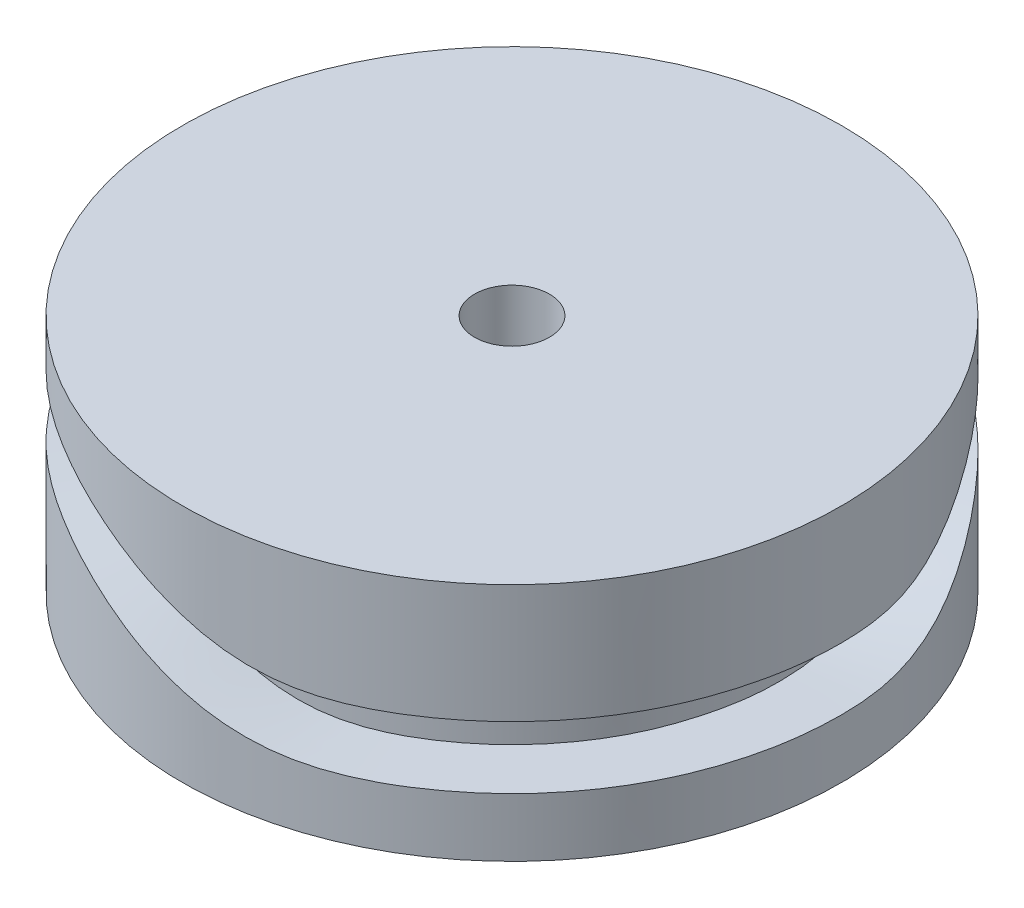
ISO-10303-21;
HEADER;
FILE_DESCRIPTION(('STEP AP214'),'2;1');
FILE_NAME('part.step','',(''),(''),'','','');
FILE_SCHEMA(('AUTOMOTIVE_DESIGN { 1 0 10303 214 1 1 1 1 }'));
ENDSEC;
DATA;
#1=APPLICATION_CONTEXT('core data for automotive mechanical design processes');
#2=APPLICATION_PROTOCOL_DEFINITION('international standard','automotive_design',2000,#1);
#3=PRODUCT_CONTEXT('',#1,'mechanical');
#4=PRODUCT('Part','Part','',(#3));
#5=PRODUCT_RELATED_PRODUCT_CATEGORY('part','',(#4));
#6=PRODUCT_DEFINITION_FORMATION('','',#4);
#7=PRODUCT_DEFINITION_CONTEXT('part definition',#1,'design');
#8=PRODUCT_DEFINITION('design','',#6,#7);
#9=PRODUCT_DEFINITION_SHAPE('','',#8);
#10=(LENGTH_UNIT() NAMED_UNIT(*) SI_UNIT(.MILLI.,.METRE.));
#11=(NAMED_UNIT(*) PLANE_ANGLE_UNIT() SI_UNIT($,.RADIAN.));
#12=(NAMED_UNIT(*) SI_UNIT($,.STERADIAN.) SOLID_ANGLE_UNIT());
#13=UNCERTAINTY_MEASURE_WITH_UNIT(LENGTH_MEASURE(1.E-05),#10,'distance_accuracy_value','');
#14=(GEOMETRIC_REPRESENTATION_CONTEXT(3) GLOBAL_UNCERTAINTY_ASSIGNED_CONTEXT((#13)) GLOBAL_UNIT_ASSIGNED_CONTEXT((#10,
#11,#12)) REPRESENTATION_CONTEXT('',''));
#15=CARTESIAN_POINT('',(0.,0.,0.));
#16=DIRECTION('',(0.,0.,1.));
#17=DIRECTION('',(1.,0.,0.));
#18=AXIS2_PLACEMENT_3D('',#15,#16,#17);
#19=CARTESIAN_POINT('',(0.,0.,0.));
#20=DIRECTION('',(0.,-1.,0.));
#21=DIRECTION('',(0.,0.,-1.));
#22=AXIS2_PLACEMENT_3D('',#19,#20,#21);
#23=CYLINDRICAL_SURFACE('',#22,34.925);
#24=CARTESIAN_POINT('',(0.,49.0220541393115,-34.925));
#25=CARTESIAN_POINT('',(0.490296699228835,49.0220326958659,-34.9250006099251));
#26=CARTESIAN_POINT('',(0.980577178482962,49.0219991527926,-34.914674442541));
#27=CARTESIAN_POINT('',(1.96039802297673,49.0219146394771,-34.8733844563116));
#28=CARTESIAN_POINT('',(2.44993817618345,49.0218636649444,-34.8424155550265));
#29=CARTESIAN_POINT('',(3.42734597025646,49.0217864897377,-34.7598834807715));
#30=CARTESIAN_POINT('',(3.91521336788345,49.0217602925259,-34.7083174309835));
#31=CARTESIAN_POINT('',(4.8883608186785,49.0217625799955,-34.5846806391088));
#32=CARTESIAN_POINT('',(5.37364078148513,49.0217910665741,-34.512609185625));
#33=CARTESIAN_POINT('',(6.34174484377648,49.0219575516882,-34.3479182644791));
#34=CARTESIAN_POINT('',(6.82456169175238,49.0220957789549,-34.255256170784));
#35=CARTESIAN_POINT('',(7.78582419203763,49.0224146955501,-34.0496420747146));
#36=CARTESIAN_POINT('',(8.26427011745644,49.0225953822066,-33.9366913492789));
#37=CARTESIAN_POINT('',(9.21593226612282,49.0228417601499,-33.6907071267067));
#38=CARTESIAN_POINT('',(9.6891488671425,49.0229074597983,-33.55767509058));
#39=CARTESIAN_POINT('',(10.629513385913,49.0228004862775,-33.271768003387));
#40=CARTESIAN_POINT('',(11.0966618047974,49.0226278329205,-33.118894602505));
#41=CARTESIAN_POINT('',(11.9316095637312,49.0219312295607,-32.8260127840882));
#42=CARTESIAN_POINT('',(12.3006459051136,49.0214841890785,-32.6895169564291));
#43=CARTESIAN_POINT('',(13.0339044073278,49.0205110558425,-32.4041314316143));
#44=CARTESIAN_POINT('',(13.3981265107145,49.0199849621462,-32.2552415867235));
#45=CARTESIAN_POINT('',(14.1213651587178,49.0191481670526,-31.9452263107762));
#46=CARTESIAN_POINT('',(14.4803812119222,49.0188374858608,-31.7840997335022));
#47=CARTESIAN_POINT('',(15.1928274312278,49.0186847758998,-31.4497771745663));
#48=CARTESIAN_POINT('',(15.546256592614,49.0188428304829,-31.2765790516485));
#49=CARTESIAN_POINT('',(16.2471515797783,49.0199158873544,-30.9182896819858));
#50=CARTESIAN_POINT('',(16.5946158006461,49.0208310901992,-30.7331952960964));
#51=CARTESIAN_POINT('',(17.2820002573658,49.0235230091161,-30.351969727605));
#52=CARTESIAN_POINT('',(17.6219408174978,49.0252970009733,-30.1558751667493));
#53=CARTESIAN_POINT('',(18.2950079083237,49.0263739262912,-29.7523487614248));
#54=CARTESIAN_POINT('',(18.6281348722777,49.025677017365,-29.54491764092));
#55=CARTESIAN_POINT('',(19.2870568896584,49.0188946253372,-29.1190468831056));
#56=CARTESIAN_POINT('',(19.6128546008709,49.0128111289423,-28.9006113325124));
#57=CARTESIAN_POINT('',(20.2566425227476,48.9926374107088,-28.4530781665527));
#58=CARTESIAN_POINT('',(20.5746356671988,48.9785502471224,-28.2239846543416));
#59=CARTESIAN_POINT('',(21.045395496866,48.9497826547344,-27.8726623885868));
#60=CARTESIAN_POINT('',(21.2012786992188,48.9389204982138,-27.7542733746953));
#61=CARTESIAN_POINT('',(21.5108981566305,48.9144012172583,-27.5149988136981));
#62=CARTESIAN_POINT('',(21.6646344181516,48.9007441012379,-27.3941132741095));
#63=CARTESIAN_POINT('',(21.964770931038,48.8710632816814,-27.1540079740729));
#64=CARTESIAN_POINT('',(22.111244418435,48.8551341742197,-27.0348680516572));
#65=CARTESIAN_POINT('',(22.4020508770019,48.8205851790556,-26.7943901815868));
#66=CARTESIAN_POINT('',(22.5463838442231,48.80196528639,-26.6730522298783));
#67=CARTESIAN_POINT('',(22.97616554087,48.7419980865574,-26.3057690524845));
#68=CARTESIAN_POINT('',(23.2583229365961,48.6965505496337,-26.0566138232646));
#69=CARTESIAN_POINT('',(23.8133134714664,48.5942492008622,-25.5503968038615));
#70=CARTESIAN_POINT('',(24.0861469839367,48.5373958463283,-25.2933353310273));
#71=CARTESIAN_POINT('',(24.4879704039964,48.4430161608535,-24.9024067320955));
#72=CARTESIAN_POINT('',(24.6206617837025,48.4100431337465,-24.7712202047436));
#73=CARTESIAN_POINT('',(24.8835207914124,48.340941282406,-24.5071564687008));
#74=CARTESIAN_POINT('',(25.0136884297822,48.3048124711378,-24.374279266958));
#75=CARTESIAN_POINT('',(25.2716956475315,48.2291910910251,-24.1066721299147));
#76=CARTESIAN_POINT('',(25.3995298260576,48.1896916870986,-23.9719389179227));
#77=CARTESIAN_POINT('',(25.6525160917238,48.1072341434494,-23.7010210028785));
#78=CARTESIAN_POINT('',(25.7776681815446,48.0642760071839,-23.5648363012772));
#79=CARTESIAN_POINT('',(26.0252691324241,47.975079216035,-23.2910937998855));
#80=CARTESIAN_POINT('',(26.1477180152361,47.928840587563,-23.1535360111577));
#81=CARTESIAN_POINT('',(26.3899022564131,47.8332710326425,-22.8771163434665));
#82=CARTESIAN_POINT('',(26.5096375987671,47.7839400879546,-22.7382544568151));
#83=CARTESIAN_POINT('',(26.864783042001,47.6315760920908,-22.3197879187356));
#84=CARTESIAN_POINT('',(27.096130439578,47.5241726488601,-22.0383047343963));
#85=CARTESIAN_POINT('',(27.5479364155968,47.2992021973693,-21.4708719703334));
#86=CARTESIAN_POINT('',(27.7683976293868,47.1816376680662,-21.184923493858));
#87=CARTESIAN_POINT('',(28.2891629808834,46.886388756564,-20.4875528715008));
#88=CARTESIAN_POINT('',(28.5840329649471,46.7042213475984,-20.0739589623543));
#89=CARTESIAN_POINT('',(29.1527874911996,46.3260560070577,-19.2386606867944));
#90=CARTESIAN_POINT('',(29.4266666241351,46.1300545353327,-18.8169542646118));
#91=CARTESIAN_POINT('',(29.9544640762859,45.7289337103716,-17.9648865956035));
#92=CARTESIAN_POINT('',(30.2083645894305,45.5238064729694,-17.5345180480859));
#93=CARTESIAN_POINT('',(30.5748437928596,45.2135851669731,-16.8818487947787));
#94=CARTESIAN_POINT('',(30.6946624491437,45.1097057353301,-16.6629992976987));
#95=CARTESIAN_POINT('',(30.9295805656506,44.9019179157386,-16.222790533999));
#96=CARTESIAN_POINT('',(31.0446800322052,44.7980095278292,-16.0014312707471));
#97=CARTESIAN_POINT('',(31.2694840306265,44.5917655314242,-15.5575208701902));
#98=CARTESIAN_POINT('',(31.3792204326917,44.4894240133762,-15.3349886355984));
#99=CARTESIAN_POINT('',(31.5941876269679,44.2863015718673,-14.8870625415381));
#100=CARTESIAN_POINT('',(31.6994184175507,44.1855206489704,-14.6616686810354));
#101=CARTESIAN_POINT('',(32.0082298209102,43.8864391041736,-13.981307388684));
#102=CARTESIAN_POINT('',(32.2050845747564,43.6912557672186,-13.5218542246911));
#103=CARTESIAN_POINT('',(32.4866301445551,43.4089454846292,-12.8233134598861));
#104=CARTESIAN_POINT('',(32.5781427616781,43.3166339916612,-12.5890375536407));
#105=CARTESIAN_POINT('',(32.7565976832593,43.1362498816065,-12.1171193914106));
#106=CARTESIAN_POINT('',(32.843539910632,43.0481773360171,-11.879477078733));
#107=CARTESIAN_POINT('',(33.0127345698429,42.8771993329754,-11.4008496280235));
#108=CARTESIAN_POINT('',(33.0949896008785,42.794291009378,-11.1598664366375));
#109=CARTESIAN_POINT('',(33.2547692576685,42.6346476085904,-10.6743269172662));
#110=CARTESIAN_POINT('',(33.3322942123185,42.5579121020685,-10.4297708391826));
#111=CARTESIAN_POINT('',(33.4942268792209,42.3999559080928,-9.89853946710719));
#112=CARTESIAN_POINT('',(33.5778135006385,42.3199121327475,-9.61126121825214));
#113=CARTESIAN_POINT('',(33.7382282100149,42.1700732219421,-9.03204933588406));
#114=CARTESIAN_POINT('',(33.81505374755,42.1002819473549,-8.74011399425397));
#115=CARTESIAN_POINT('',(33.9616101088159,41.9716484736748,-8.15208350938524));
#116=CARTESIAN_POINT('',(34.0313411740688,41.9128059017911,-7.85598850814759));
#117=CARTESIAN_POINT('',(34.1633957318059,41.8063299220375,-7.26023980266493));
#118=CARTESIAN_POINT('',(34.2257211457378,41.7586936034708,-6.96058704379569));
#119=CARTESIAN_POINT('',(34.3426895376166,41.6744223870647,-6.35840527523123));
#120=CARTESIAN_POINT('',(34.3973363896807,41.6377819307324,-6.05587779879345));
#121=CARTESIAN_POINT('',(34.4735700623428,41.5905529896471,-5.59934055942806));
#122=CARTESIAN_POINT('',(34.4980946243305,41.5760646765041,-5.4462074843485));
#123=CARTESIAN_POINT('',(34.5451307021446,41.5495226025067,-5.13942128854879));
#124=CARTESIAN_POINT('',(34.5676422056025,41.5374688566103,-4.98576816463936));
#125=CARTESIAN_POINT('',(34.6321327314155,41.50446988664,-4.52411007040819));
#126=CARTESIAN_POINT('',(34.6710610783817,41.4866909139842,-4.21544642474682));
#127=CARTESIAN_POINT('',(34.7406965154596,41.4575774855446,-3.59674966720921));
#128=CARTESIAN_POINT('',(34.7713993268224,41.4462463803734,-3.28671592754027));
#129=CARTESIAN_POINT('',(34.824518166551,41.4283766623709,-2.66565908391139));
#130=CARTESIAN_POINT('',(34.8469302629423,41.4218403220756,-2.35463558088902));
#131=CARTESIAN_POINT('',(34.8834217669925,41.4121113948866,-1.7319896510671));
#132=CARTESIAN_POINT('',(34.8974994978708,41.4089194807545,-1.42036711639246));
#133=CARTESIAN_POINT('',(34.9151956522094,41.4049904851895,-0.86316004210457));
#134=CARTESIAN_POINT('',(34.9204018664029,41.4038756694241,-0.617627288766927));
#135=CARTESIAN_POINT('',(34.9243261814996,41.4026315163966,-0.249286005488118));
#136=CARTESIAN_POINT('',(34.9249867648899,41.4022881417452,-0.126496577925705));
#137=CARTESIAN_POINT('',(34.9250128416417,41.4016578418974,0.119082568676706));
#138=CARTESIAN_POINT('',(34.9243783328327,41.4013709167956,0.241872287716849));
#139=CARTESIAN_POINT('',(34.9205329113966,41.4005901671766,0.610141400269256));
#140=CARTESIAN_POINT('',(34.9153809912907,41.4001761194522,0.855604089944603));
#141=CARTESIAN_POINT('',(34.8999028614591,41.3995359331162,1.3463587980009));
#142=CARTESIAN_POINT('',(34.8895766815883,41.3993097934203,1.59165081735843));
#143=CARTESIAN_POINT('',(34.8508462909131,41.3988704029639,2.32703387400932));
#144=CARTESIAN_POINT('',(34.8146890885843,41.3988959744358,2.81674094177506));
#145=CARTESIAN_POINT('',(34.7217648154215,41.3993157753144,3.79416508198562));
#146=CARTESIAN_POINT('',(34.6649982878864,41.3997099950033,4.28188220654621));
#147=CARTESIAN_POINT('',(34.5310488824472,41.4005950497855,5.25381685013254));
#148=CARTESIAN_POINT('',(34.4538945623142,41.4010857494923,5.73803829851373));
#149=CARTESIAN_POINT('',(34.2792633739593,41.4018840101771,6.70284189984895));
#150=CARTESIAN_POINT('',(34.1817848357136,41.4021915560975,7.18342375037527));
#151=CARTESIAN_POINT('',(33.9666758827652,41.4025783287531,8.1400811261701));
#152=CARTESIAN_POINT('',(33.8490446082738,41.4026575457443,8.61615645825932));
#153=CARTESIAN_POINT('',(33.5938463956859,41.4026973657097,9.56292363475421));
#154=CARTESIAN_POINT('',(33.4562793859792,41.4026579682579,10.0336154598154));
#155=CARTESIAN_POINT('',(33.1121073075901,41.4024919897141,11.1252897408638));
#156=CARTESIAN_POINT('',(32.8978036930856,41.4023406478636,11.7438622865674));
#157=CARTESIAN_POINT('',(32.4347940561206,41.4020865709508,12.9679602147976));
#158=CARTESIAN_POINT('',(32.1860886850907,41.4019838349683,13.5734858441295));
#159=CARTESIAN_POINT('',(31.6550536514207,41.4019017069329,14.7696093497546));
#160=CARTESIAN_POINT('',(31.3727242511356,41.4019223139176,15.3602073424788));
#161=CARTESIAN_POINT('',(30.775367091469,41.4019900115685,16.5245420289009));
#162=CARTESIAN_POINT('',(30.4603430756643,41.4020370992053,17.0982806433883));
#163=CARTESIAN_POINT('',(29.7985626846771,41.4020923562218,18.2271602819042));
#164=CARTESIAN_POINT('',(29.4518060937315,41.4021005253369,18.7823011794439));
#165=CARTESIAN_POINT('',(28.7276565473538,41.4019808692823,19.872228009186));
#166=CARTESIAN_POINT('',(28.3502637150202,41.4018530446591,20.4070140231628));
#167=CARTESIAN_POINT('',(27.5661698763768,41.4015782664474,21.4543638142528));
#168=CARTESIAN_POINT('',(27.1594785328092,41.4014313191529,21.9669348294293));
#169=CARTESIAN_POINT('',(26.3179265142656,41.4012813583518,22.9684593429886));
#170=CARTESIAN_POINT('',(25.8830657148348,41.4012783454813,23.4574127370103));
#171=CARTESIAN_POINT('',(25.2107466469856,41.4014870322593,24.1719026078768));
#172=CARTESIAN_POINT('',(24.9832894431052,41.4015921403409,24.4069214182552));
#173=CARTESIAN_POINT('',(24.5218676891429,41.4019039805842,24.8704762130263));
#174=CARTESIAN_POINT('',(24.2879031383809,41.4021107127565,25.0990121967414));
#175=CARTESIAN_POINT('',(23.5757433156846,41.4028215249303,25.7753559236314));
#176=CARTESIAN_POINT('',(23.0879606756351,41.4034158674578,26.2131780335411));
#177=CARTESIAN_POINT('',(22.3384942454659,41.4039161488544,26.8487369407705));
#178=CARTESIAN_POINT('',(22.0856950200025,41.4040176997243,27.0570696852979));
#179=CARTESIAN_POINT('',(21.5743256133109,41.4039996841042,27.4665499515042));
#180=CARTESIAN_POINT('',(21.3157554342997,41.4038801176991,27.6676974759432));
#181=CARTESIAN_POINT('',(20.7930746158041,41.4033381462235,28.0626257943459));
#182=CARTESIAN_POINT('',(20.5289642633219,41.4029157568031,28.2564069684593));
#183=CARTESIAN_POINT('',(19.9953974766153,41.4016450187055,28.6364625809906));
#184=CARTESIAN_POINT('',(19.7259410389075,41.4007966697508,28.822737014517));
#185=CARTESIAN_POINT('',(19.1810653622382,41.3990314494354,29.1881874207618));
#186=CARTESIAN_POINT('',(18.9056305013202,41.3981143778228,29.3673401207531));
#187=CARTESIAN_POINT('',(18.3498275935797,41.3966501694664,29.7177962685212));
#188=CARTESIAN_POINT('',(18.0694595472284,41.3961030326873,29.8890997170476));
#189=CARTESIAN_POINT('',(17.2212200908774,41.3956493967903,30.3910645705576));
#190=CARTESIAN_POINT('',(16.6461918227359,41.39693053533,30.7097949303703));
#191=CARTESIAN_POINT('',(15.7709018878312,41.4040765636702,31.163157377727));
#192=CARTESIAN_POINT('',(15.4769515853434,41.4073305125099,31.3101839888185));
#193=CARTESIAN_POINT('',(14.8850332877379,41.4161949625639,31.595875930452));
#194=CARTESIAN_POINT('',(14.5870652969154,41.4218054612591,31.7345412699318));
#195=CARTESIAN_POINT('',(13.9888114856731,41.4362584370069,32.0027458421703));
#196=CARTESIAN_POINT('',(13.6885431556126,41.4450855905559,32.1323249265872));
#197=CARTESIAN_POINT('',(13.0846087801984,41.466893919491,32.3829510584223));
#198=CARTESIAN_POINT('',(12.780942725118,41.4798751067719,32.5039980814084));
#199=CARTESIAN_POINT('',(12.1706565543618,41.5109502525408,32.7374013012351));
#200=CARTESIAN_POINT('',(11.864037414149,41.5290425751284,32.8497602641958));
#201=CARTESIAN_POINT('',(11.2481341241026,41.5713228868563,33.0657161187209));
#202=CARTESIAN_POINT('',(10.9388500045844,41.5955108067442,33.1693131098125));
#203=CARTESIAN_POINT('',(10.4733601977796,41.6370985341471,33.3180263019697));
#204=CARTESIAN_POINT('',(10.3179719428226,41.651841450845,33.3664733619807));
#205=CARTESIAN_POINT('',(10.0067077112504,41.6832091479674,33.4611399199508));
#206=CARTESIAN_POINT('',(9.85083173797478,41.6998339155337,33.5073594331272));
#207=CARTESIAN_POINT('',(9.38256130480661,41.7525332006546,33.6426628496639));
#208=CARTESIAN_POINT('',(9.06951180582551,41.7914338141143,33.7283956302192));
#209=CARTESIAN_POINT('',(8.17396914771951,41.9132936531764,33.9603142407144));
#210=CARTESIAN_POINT('',(7.58984466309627,42.0054944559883,34.0955483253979));
#211=CARTESIAN_POINT('',(6.41957072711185,42.2153368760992,34.3351376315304));
#212=CARTESIAN_POINT('',(5.83342047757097,42.3329900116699,34.4394788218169));
#213=CARTESIAN_POINT('',(4.95477421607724,42.5274746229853,34.5730196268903));
#214=CARTESIAN_POINT('',(4.66196245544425,42.5953105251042,34.6137073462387));
#215=CARTESIAN_POINT('',(4.07671411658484,42.7365055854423,34.6875049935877));
#216=CARTESIAN_POINT('',(3.78427754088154,42.8098647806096,34.7206148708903));
#217=CARTESIAN_POINT('',(2.9048697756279,43.0379886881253,34.8089885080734));
#218=CARTESIAN_POINT('',(2.31864025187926,43.2001602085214,34.8528663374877));
#219=CARTESIAN_POINT('',(1.14913881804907,43.5393443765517,34.9109997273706));
#220=CARTESIAN_POINT('',(0.565866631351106,43.7163556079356,34.9252581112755));
#221=CARTESIAN_POINT('',(-0.306500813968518,43.9897831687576,34.9248656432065));
#222=CARTESIAN_POINT('',(-0.596885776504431,44.0822505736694,34.9211038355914));
#223=CARTESIAN_POINT('',(-1.17682744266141,44.2691863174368,34.9063724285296));
#224=CARTESIAN_POINT('',(-1.46638414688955,44.3636546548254,34.8954028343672));
#225=CARTESIAN_POINT('',(-2.30758761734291,44.6403167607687,34.8530664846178));
#226=CARTESIAN_POINT('',(-2.85822820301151,44.824198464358,34.8122226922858));
#227=CARTESIAN_POINT('',(-3.95682820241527,45.1920445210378,34.7045199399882));
#228=CARTESIAN_POINT('',(-4.50478795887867,45.3760088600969,34.6376643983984));
#229=CARTESIAN_POINT('',(-5.59824440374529,45.7400020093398,34.4778276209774));
#230=CARTESIAN_POINT('',(-6.14374095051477,45.920030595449,34.3848449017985));
#231=CARTESIAN_POINT('',(-7.23014509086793,46.2716378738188,34.1728802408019));
#232=CARTESIAN_POINT('',(-7.77106219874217,46.4432454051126,34.0539959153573));
#233=CARTESIAN_POINT('',(-8.58014875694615,46.6920904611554,33.8557789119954));
#234=CARTESIAN_POINT('',(-8.84946937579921,46.7736130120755,33.7863895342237));
#235=CARTESIAN_POINT('',(-9.38728772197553,46.9333766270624,33.6409283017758));
#236=CARTESIAN_POINT('',(-9.65578544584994,47.0116176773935,33.564856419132));
#237=CARTESIAN_POINT('',(-10.1918469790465,47.1643740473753,33.4059878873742));
#238=CARTESIAN_POINT('',(-10.4594108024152,47.2388894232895,33.3231913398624));
#239=CARTESIAN_POINT('',(-10.9934621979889,47.383811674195,33.1508392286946));
#240=CARTESIAN_POINT('',(-11.2599497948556,47.4542186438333,33.0612838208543));
#241=CARTESIAN_POINT('',(-11.9129668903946,47.6219266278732,32.8329870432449));
#242=CARTESIAN_POINT('',(-12.2987917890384,47.7168416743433,32.6904469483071));
#243=CARTESIAN_POINT('',(-13.0671314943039,47.8970256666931,32.3909823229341));
#244=CARTESIAN_POINT('',(-13.449646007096,47.9822937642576,32.2340565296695));
#245=CARTESIAN_POINT('',(-14.2106677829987,48.142498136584,31.9058650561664));
#246=CARTESIAN_POINT('',(-14.5891752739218,48.2174350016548,31.7346001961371));
#247=CARTESIAN_POINT('',(-15.1533700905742,48.3215232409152,31.4670357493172));
#248=CARTESIAN_POINT('',(-15.34084184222,48.3548333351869,31.3760691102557));
#249=CARTESIAN_POINT('',(-15.7145208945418,48.418575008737,31.1905909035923));
#250=CARTESIAN_POINT('',(-15.9007281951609,48.4490065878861,31.0960793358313));
#251=CARTESIAN_POINT('',(-16.272005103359,48.5071317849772,30.9034185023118));
#252=CARTESIAN_POINT('',(-16.4570728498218,48.5348216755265,30.805264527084));
#253=CARTESIAN_POINT('',(-16.8257023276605,48.5875243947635,30.6054786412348));
#254=CARTESIAN_POINT('',(-17.0092640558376,48.6125372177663,30.5038467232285));
#255=CARTESIAN_POINT('',(-17.557565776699,48.6837127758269,30.1937712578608));
#256=CARTESIAN_POINT('',(-17.9199062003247,48.7260100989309,29.9801563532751));
#257=CARTESIAN_POINT('',(-18.6373412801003,48.8010067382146,29.5395055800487));
#258=CARTESIAN_POINT('',(-18.9924356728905,48.8337057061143,29.3124692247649));
#259=CARTESIAN_POINT('',(-19.6946196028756,48.8900954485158,28.8453699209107));
#260=CARTESIAN_POINT('',(-20.0417101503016,48.9137873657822,28.6053086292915));
#261=CARTESIAN_POINT('',(-20.7252638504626,48.9526369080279,28.1139679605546));
#262=CARTESIAN_POINT('',(-21.0617771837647,48.967843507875,27.8627621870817));
#263=CARTESIAN_POINT('',(-21.7256453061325,48.9916045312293,27.3482781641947));
#264=CARTESIAN_POINT('',(-22.0530005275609,49.0001592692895,27.0850004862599));
#265=CARTESIAN_POINT('',(-22.6980763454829,49.0124061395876,26.5467402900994));
#266=CARTESIAN_POINT('',(-23.0157963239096,49.0160979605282,26.2717570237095));
#267=CARTESIAN_POINT('',(-23.4847743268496,49.0194591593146,25.8508247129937));
#268=CARTESIAN_POINT('',(-23.6398382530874,49.0202167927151,25.7090996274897));
#269=CARTESIAN_POINT('',(-23.9473865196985,49.021259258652,25.4228721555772));
#270=CARTESIAN_POINT('',(-24.0998708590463,49.0215440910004,25.2783697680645));
#271=CARTESIAN_POINT('',(-24.4022640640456,49.0219265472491,24.9865823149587));
#272=CARTESIAN_POINT('',(-24.5521719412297,49.022024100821,24.8392962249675));
#273=CARTESIAN_POINT('',(-24.8493030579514,49.0222087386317,24.5420440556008));
#274=CARTESIAN_POINT('',(-24.9965262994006,49.0222958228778,24.3920779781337));
#275=CARTESIAN_POINT('',(-25.4340816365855,49.0225071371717,23.9382480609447));
#276=CARTESIAN_POINT('',(-25.7203279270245,49.0225814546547,23.6304249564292));
#277=CARTESIAN_POINT('',(-26.281520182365,49.0226473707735,23.0046508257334));
#278=CARTESIAN_POINT('',(-26.5564660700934,49.0226389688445,22.6866997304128));
#279=CARTESIAN_POINT('',(-27.0947167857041,49.0225661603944,22.0410665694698));
#280=CARTESIAN_POINT('',(-27.3580208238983,49.0225017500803,21.7133838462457));
#281=CARTESIAN_POINT('',(-28.0089098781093,49.0223091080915,20.8727050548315));
#282=CARTESIAN_POINT('',(-28.3884737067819,49.0221651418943,20.3534636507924));
#283=CARTESIAN_POINT('',(-29.1183886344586,49.0219542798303,19.2947807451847));
#284=CARTESIAN_POINT('',(-29.4687363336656,49.0218873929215,18.755336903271));
#285=CARTESIAN_POINT('',(-30.1391310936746,49.0218223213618,17.6579112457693));
#286=CARTESIAN_POINT('',(-30.4591773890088,49.0218241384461,17.0999289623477));
#287=CARTESIAN_POINT('',(-31.0680268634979,49.0218591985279,15.9670581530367));
#288=CARTESIAN_POINT('',(-31.3568248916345,49.0218924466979,15.3921668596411));
#289=CARTESIAN_POINT('',(-31.9022346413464,49.0219591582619,14.2273180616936));
#290=CARTESIAN_POINT('',(-32.1588471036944,49.021992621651,13.6373609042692));
#291=CARTESIAN_POINT('',(-32.6390993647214,49.0220347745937,12.444215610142));
#292=CARTESIAN_POINT('',(-32.8627390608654,49.0220434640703,11.8410274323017));
#293=CARTESIAN_POINT('',(-33.3853034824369,49.0220482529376,10.3024526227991));
#294=CARTESIAN_POINT('',(-33.6618725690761,49.0220353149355,9.35936820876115));
#295=CARTESIAN_POINT('',(-34.134557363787,49.0220094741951,7.45332307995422));
#296=CARTESIAN_POINT('',(-34.3306714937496,49.0219965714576,6.49036197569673));
#297=CARTESIAN_POINT('',(-34.6410944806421,49.0219855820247,4.5512863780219));
#298=CARTESIAN_POINT('',(-34.7554006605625,49.0219874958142,3.57517145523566));
#299=CARTESIAN_POINT('',(-34.9013722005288,49.0219938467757,1.6167929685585));
#300=CARTESIAN_POINT('',(-34.9330379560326,49.0219982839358,0.634529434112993));
#301=CARTESIAN_POINT('',(-34.9135080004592,49.022003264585,-1.32916455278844));
#302=CARTESIAN_POINT('',(-34.8623131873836,49.0220038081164,-2.31059501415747));
#303=CARTESIAN_POINT('',(-34.6774267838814,49.0220031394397,-4.26565503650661));
#304=CARTESIAN_POINT('',(-34.5437351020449,49.0220019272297,-5.23928458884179));
#305=CARTESIAN_POINT('',(-34.1948081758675,49.022000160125,-7.17180593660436));
#306=CARTESIAN_POINT('',(-33.9795741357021,49.0219996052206,-8.13069794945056));
#307=CARTESIAN_POINT('',(-33.4690924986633,49.0219993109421,-10.026941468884));
#308=CARTESIAN_POINT('',(-33.173844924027,49.0219995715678,-10.9642929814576));
#309=CARTESIAN_POINT('',(-32.505427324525,49.0220000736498,-12.8108136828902));
#310=CARTESIAN_POINT('',(-32.1322554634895,49.0220003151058,-13.7199822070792));
#311=CARTESIAN_POINT('',(-31.3106464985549,49.02200049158,-15.5036501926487));
#312=CARTESIAN_POINT('',(-30.86220937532,49.0220004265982,-16.3781496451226));
#313=CARTESIAN_POINT('',(-29.8932738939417,49.0220002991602,-18.0862341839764));
#314=CARTESIAN_POINT('',(-29.3727778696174,49.0220002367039,-18.9198205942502));
#315=CARTESIAN_POINT('',(-28.2634143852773,49.0220003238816,-20.5401824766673));
#316=CARTESIAN_POINT('',(-27.6745469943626,49.0220004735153,-21.3269579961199));
#317=CARTESIAN_POINT('',(-26.4326911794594,49.0220006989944,-22.8480267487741));
#318=CARTESIAN_POINT('',(-25.7797094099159,49.0220007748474,-23.5823254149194));
#319=CARTESIAN_POINT('',(-24.4142122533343,49.0220003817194,-24.9933138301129));
#320=CARTESIAN_POINT('',(-23.7016966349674,49.0219999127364,-25.6700033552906));
#321=CARTESIAN_POINT('',(-22.222018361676,49.0219989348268,-26.9611176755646));
#322=CARTESIAN_POINT('',(-21.4548424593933,49.0219984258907,-27.5755272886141));
#323=CARTESIAN_POINT('',(-19.8714646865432,49.021998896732,-28.7375159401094));
#324=CARTESIAN_POINT('',(-19.0552635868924,49.021999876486,-29.2850960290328));
#325=CARTESIAN_POINT('',(-17.3792703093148,49.0220031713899,-30.3097631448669));
#326=CARTESIAN_POINT('',(-16.5194595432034,49.0220054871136,-30.7868197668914));
#327=CARTESIAN_POINT('',(-14.7626222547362,49.0220070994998,-31.6667938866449));
#328=CARTESIAN_POINT('',(-13.8655932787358,49.0220063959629,-32.0697064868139));
#329=CARTESIAN_POINT('',(-12.0417500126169,49.0219971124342,-32.7980980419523));
#330=CARTESIAN_POINT('',(-11.1149679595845,49.0219885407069,-33.1236577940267));
#331=CARTESIAN_POINT('',(-9.23742728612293,49.0219767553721,-33.6955199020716));
#332=CARTESIAN_POINT('',(-8.28667499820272,49.0219735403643,-33.9418429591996));
#333=CARTESIAN_POINT('',(-6.7258029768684,49.0219869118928,-34.2767867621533));
#334=CARTESIAN_POINT('',(-6.12083634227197,49.0219965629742,-34.3899646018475));
#335=CARTESIAN_POINT('',(-4.90578435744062,49.0220248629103,-34.584205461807));
#336=CARTESIAN_POINT('',(-4.2956994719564,49.0220435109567,-34.6652713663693));
#337=CARTESIAN_POINT('',(-3.07214931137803,49.0220736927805,-34.7950576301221));
#338=CARTESIAN_POINT('',(-2.45868423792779,49.0220852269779,-34.8437798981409));
#339=CARTESIAN_POINT('',(-1.23013738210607,49.0220888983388,-34.9087476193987));
#340=CARTESIAN_POINT('',(-0.615055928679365,49.0220810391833,-34.9249992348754));
#341=CARTESIAN_POINT('',(0.,49.0220541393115,-34.925));
#342=B_SPLINE_CURVE_WITH_KNOTS('',3,(#24,#25,#26,#27,#28,#29,#30,#31,#32,#33,#34,#35,#36,#37,
#38,#39,#40,#41,#42,#43,#44,#45,#46,#47,#48,#49,#50,#51,#52,#53,#54,#55,#56,#57,#58,#59,#60,#61,
#62,#63,#64,#65,#66,#67,#68,#69,#70,#71,#72,#73,#74,#75,#76,#77,#78,#79,#80,#81,#82,#83,#84,#85,
#86,#87,#88,#89,#90,#91,#92,#93,#94,#95,#96,#97,#98,#99,#100,#101,#102,#103,#104,#105,#106,#107,
#108,#109,#110,#111,#112,#113,#114,#115,#116,#117,#118,#119,#120,#121,#122,#123,#124,#125,#126,
#127,#128,#129,#130,#131,#132,#133,#134,#135,#136,#137,#138,#139,#140,#141,#142,#143,#144,#145,
#146,#147,#148,#149,#150,#151,#152,#153,#154,#155,#156,#157,#158,#159,#160,#161,#162,#163,#164,
#165,#166,#167,#168,#169,#170,#171,#172,#173,#174,#175,#176,#177,#178,#179,#180,#181,#182,#183,
#184,#185,#186,#187,#188,#189,#190,#191,#192,#193,#194,#195,#196,#197,#198,#199,#200,#201,#202,
#203,#204,#205,#206,#207,#208,#209,#210,#211,#212,#213,#214,#215,#216,#217,#218,#219,#220,#221,
#222,#223,#224,#225,#226,#227,#228,#229,#230,#231,#232,#233,#234,#235,#236,#237,#238,#239,#240,
#241,#242,#243,#244,#245,#246,#247,#248,#249,#250,#251,#252,#253,#254,#255,#256,#257,#258,#259,
#260,#261,#262,#263,#264,#265,#266,#267,#268,#269,#270,#271,#272,#273,#274,#275,#276,#277,#278,
#279,#280,#281,#282,#283,#284,#285,#286,#287,#288,#289,#290,#291,#292,#293,#294,#295,#296,#297,
#298,#299,#300,#301,#302,#303,#304,#305,#306,#307,#308,#309,#310,#311,#312,#313,#314,#315,#316,
#317,#318,#319,#320,#321,#322,#323,#324,#325,#326,#327,#328,#329,#330,#331,#332,#333,#334,#335,
#336,#337,#338,#339,#340,#341),.UNSPECIFIED.,.T.,.F.,(4,2,2,2,2,2,2,2,2,2,2,2,2,2,2,2,2,2,2,2,2,
2,2,2,2,2,2,2,2,2,2,2,2,2,2,2,2,2,2,2,2,2,2,2,2,2,2,2,2,2,2,2,2,2,2,2,2,2,2,2,2,2,2,2,2,2,2,2,2,
2,2,2,2,2,2,2,2,2,2,2,2,2,2,2,2,2,2,2,2,2,2,2,2,2,2,2,2,2,2,2,2,2,2,2,2,2,2,2,2,2,2,2,2,2,2,2,2,
2,2,2,2,2,2,2,2,2,2,2,2,2,2,2,2,2,2,2,2,2,2,2,2,2,2,2,2,2,2,2,2,2,2,2,2,2,2,2,2,2,4),(0.,
1.47075334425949,2.94186893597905,4.41319007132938,5.8845622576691,7.35900928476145,
8.8333635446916,10.3076105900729,11.7817351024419,12.9619324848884,14.1421439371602,
15.3224660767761,16.5029981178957,17.6838429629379,18.8609662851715,20.0380145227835,
21.2146288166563,22.3907938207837,22.9788884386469,23.566981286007,24.1353750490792,
24.7037698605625,25.8408449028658,26.977874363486,27.5462837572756,28.1146908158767,
28.6842792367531,29.2538670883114,29.8234503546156,30.3930369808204,31.5322199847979,
32.6711258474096,34.2892230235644,35.9077357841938,37.5276750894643,38.338425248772,
39.1491743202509,39.954302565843,40.7594311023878,42.3685728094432,43.1722616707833,
43.9759640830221,44.7792163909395,45.5824127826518,46.5112854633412,47.4405070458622,
48.3696969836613,49.298645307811,50.2271232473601,50.6943735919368,51.1616268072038,
52.0962555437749,53.0313695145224,53.966926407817,54.9026714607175,55.6393854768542,
56.0077543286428,56.3761237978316,57.1126127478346,57.8490974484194,59.3217399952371,
60.7943437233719,62.2648955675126,63.7355682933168,65.2063037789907,66.677044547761,
68.6398937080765,70.602705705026,72.565502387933,74.5280745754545,76.4906601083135,
78.4532377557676,80.4151710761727,82.3771130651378,83.3581904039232,84.3392678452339,
86.3043903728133,87.2870392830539,88.269687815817,89.2522855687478,90.2348839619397,
91.2204661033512,92.2060481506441,94.177134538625,95.16308753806,96.1490394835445,
97.1303546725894,98.1116726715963,99.0926769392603,100.0736700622,100.563943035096,
101.054212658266,102.034712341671,103.853155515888,105.672423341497,106.582220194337,
107.492023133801,109.320441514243,111.148685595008,112.062929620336,112.977172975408,
114.722431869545,116.467461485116,118.212590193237,119.951252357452,120.82062634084,
121.690003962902,122.559368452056,123.428712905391,124.694699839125,125.960798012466,
127.226823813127,127.859845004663,128.492866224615,129.126736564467,129.760608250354,
131.028406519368,132.296250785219,133.563934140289,134.824223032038,136.084452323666,
137.344762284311,137.974958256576,138.605154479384,139.235587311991,139.866019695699,
141.126765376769,142.387519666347,143.648359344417,145.576857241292,147.505579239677,
149.434349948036,151.36343811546,153.292481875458,155.221531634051,158.16622343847,
161.110972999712,164.055818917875,167.000650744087,169.94545065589,172.890253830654,
175.835013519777,178.779772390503,181.724600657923,184.669429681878,187.614163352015,
190.558894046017,193.503319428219,196.447756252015,199.392909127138,202.338015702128,
205.284388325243,208.230955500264,211.17443124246,214.117137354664,215.962758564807,
217.808213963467,219.653560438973,221.498556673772),.UNSPECIFIED.);
#343=CARTESIAN_POINT('',(0.,49.0220541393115,-34.925));
#344=VERTEX_POINT('',#343);
#345=EDGE_CURVE('E126',#344,#344,#342,.T.);
#346=ORIENTED_EDGE('',*,*,#345,.F.);
#347=EDGE_LOOP('',(#346));
#348=FACE_BOUND('',#347,.T.);
#349=CARTESIAN_POINT('',(0.,53.975,0.));
#350=DIRECTION('',(0.,-1.,0.));
#351=DIRECTION('',(0.,0.,-1.));
#352=AXIS2_PLACEMENT_3D('',#349,#350,#351);
#353=CIRCLE('',#352,34.925);
#354=CARTESIAN_POINT('',(0.,53.975,-34.925));
#355=VERTEX_POINT('',#354);
#356=EDGE_CURVE('E139',#355,#355,#353,.T.);
#357=ORIENTED_EDGE('',*,*,#356,.T.);
#358=EDGE_LOOP('',(#357));
#359=FACE_BOUND('',#358,.T.);
#360=ADVANCED_FACE('F122',(#348,#359),#23,.T.);
#361=CARTESIAN_POINT('',(0.,0.,0.));
#362=DIRECTION('',(0.,-1.,0.));
#363=DIRECTION('',(0.,0.,-1.));
#364=AXIS2_PLACEMENT_3D('',#361,#362,#363);
#365=CYLINDRICAL_SURFACE('',#364,3.96875);
#366=CARTESIAN_POINT('',(0.,28.575,0.));
#367=DIRECTION('',(0.,-1.,0.));
#368=DIRECTION('',(0.,0.,-1.));
#369=AXIS2_PLACEMENT_3D('',#366,#367,#368);
#370=CIRCLE('',#369,3.96875);
#371=CARTESIAN_POINT('',(0.,28.575,-3.96875));
#372=VERTEX_POINT('',#371);
#373=EDGE_CURVE('E13',#372,#372,#370,.T.);
#374=ORIENTED_EDGE('',*,*,#373,.T.);
#375=EDGE_LOOP('',(#374));
#376=FACE_BOUND('',#375,.T.);
#377=CARTESIAN_POINT('',(0.,53.975,0.));
#378=DIRECTION('',(0.,-1.,0.));
#379=DIRECTION('',(0.,0.,-1.));
#380=AXIS2_PLACEMENT_3D('',#377,#378,#379);
#381=CIRCLE('',#380,3.96875);
#382=CARTESIAN_POINT('',(0.,53.975,-3.96875));
#383=VERTEX_POINT('',#382);
#384=EDGE_CURVE('E189',#383,#383,#381,.T.);
#385=ORIENTED_EDGE('',*,*,#384,.F.);
#386=EDGE_LOOP('',(#385));
#387=FACE_BOUND('',#386,.T.);
#388=ADVANCED_FACE('F124',(#376,#387),#365,.F.);
#389=CARTESIAN_POINT('',(3.96875,28.575,0.));
#390=DIRECTION('',(0.,-1.,0.));
#391=DIRECTION('',(0.,0.,-1.));
#392=AXIS2_PLACEMENT_3D('',#389,#390,#391);
#393=PLANE('',#392);
#394=CARTESIAN_POINT('',(0.,28.575,0.));
#395=DIRECTION('',(0.,-1.,0.));
#396=DIRECTION('',(0.,0.,-1.));
#397=AXIS2_PLACEMENT_3D('',#394,#395,#396);
#398=CIRCLE('',#397,34.925);
#399=CARTESIAN_POINT('',(0.,28.575,-34.925));
#400=VERTEX_POINT('',#399);
#401=EDGE_CURVE('E134',#400,#400,#398,.T.);
#402=ORIENTED_EDGE('',*,*,#401,.T.);
#403=EDGE_LOOP('',(#402));
#404=FACE_BOUND('',#403,.T.);
#405=ORIENTED_EDGE('',*,*,#373,.F.);
#406=EDGE_LOOP('',(#405));
#407=FACE_BOUND('',#406,.T.);
#408=ADVANCED_FACE('F175',(#404,#407),#393,.T.);
#409=CARTESIAN_POINT('',(0.,42.4180196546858,-34.925));
#410=CARTESIAN_POINT('',(-0.980992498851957,42.4180364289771,-34.9249930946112));
#411=CARTESIAN_POINT('',(-1.9621957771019,42.4180346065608,-34.8836314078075));
#412=CARTESIAN_POINT('',(-3.91781268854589,42.4180203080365,-34.7184375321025));
#413=CARTESIAN_POINT('',(-4.89222424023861,42.4180078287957,-34.5945810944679));
#414=CARTESIAN_POINT('',(-6.82831611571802,42.4179928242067,-34.2650691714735));
#415=CARTESIAN_POINT('',(-7.78998029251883,42.4179903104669,-34.0593185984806));
#416=CARTESIAN_POINT('',(-9.69246191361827,42.4179908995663,-33.5675008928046));
#417=CARTESIAN_POINT('',(-10.6332809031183,42.4179940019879,-33.2814397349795));
#418=CARTESIAN_POINT('',(-12.4870255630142,42.4179989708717,-32.6311837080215));
#419=CARTESIAN_POINT('',(-13.3999640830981,42.4180008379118,-32.2670254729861));
#420=CARTESIAN_POINT('',(-15.1919289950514,42.4180021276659,-31.4630784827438));
#421=CARTESIAN_POINT('',(-16.0709547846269,42.4180015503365,-31.0232883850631));
#422=CARTESIAN_POINT('',(-17.7885797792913,42.4180002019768,-30.0713465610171));
#423=CARTESIAN_POINT('',(-18.6271905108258,42.4179994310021,-29.5592156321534));
#424=CARTESIAN_POINT('',(-20.2582910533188,42.4179986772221,-28.4661393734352));
#425=CARTESIAN_POINT('',(-21.0507810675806,42.4179986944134,-27.8851943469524));
#426=CARTESIAN_POINT('',(-22.5841030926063,42.4179989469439,-26.6585439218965));
#427=CARTESIAN_POINT('',(-23.3249289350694,42.4179991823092,-26.0128308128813));
#428=CARTESIAN_POINT('',(-24.7495530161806,42.4179994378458,-24.6612916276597));
#429=CARTESIAN_POINT('',(-25.4333511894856,42.4179994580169,-23.9554654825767));
#430=CARTESIAN_POINT('',(-26.7390870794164,42.4179993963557,-22.4886857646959));
#431=CARTESIAN_POINT('',(-27.361022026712,42.4179993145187,-21.7277297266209));
#432=CARTESIAN_POINT('',(-28.538574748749,42.4179993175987,-20.1561285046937));
#433=CARTESIAN_POINT('',(-29.0941925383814,42.4179994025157,-19.3454833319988));
#434=CARTESIAN_POINT('',(-30.1351483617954,42.4179996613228,-17.6802871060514));
#435=CARTESIAN_POINT('',(-30.6204880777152,42.4179998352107,-16.8257371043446));
#436=CARTESIAN_POINT('',(-31.5174531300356,42.4179998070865,-15.0787886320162));
#437=CARTESIAN_POINT('',(-31.9290784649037,42.4179996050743,-14.1863901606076));
#438=CARTESIAN_POINT('',(-32.67568943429,42.4179986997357,-12.370086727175));
#439=CARTESIAN_POINT('',(-33.0106748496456,42.4179979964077,-11.4461816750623));
#440=CARTESIAN_POINT('',(-33.6016228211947,42.417997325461,-9.57343532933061));
#441=CARTESIAN_POINT('',(-33.857585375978,42.4179973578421,-8.62459403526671));
#442=CARTESIAN_POINT('',(-34.2886651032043,42.4179997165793,-6.70873716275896));
#443=CARTESIAN_POINT('',(-34.4637834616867,42.4180020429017,-5.74172185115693));
#444=CARTESIAN_POINT('',(-34.7319338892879,42.4180059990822,-3.79637021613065));
#445=CARTESIAN_POINT('',(-34.824965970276,42.4180076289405,-2.81803389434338));
#446=CARTESIAN_POINT('',(-34.928289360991,42.418003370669,-0.856999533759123));
#447=CARTESIAN_POINT('',(-34.9385784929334,42.4179974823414,0.125698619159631));
#448=CARTESIAN_POINT('',(-34.8763165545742,42.417983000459,2.08855735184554));
#449=CARTESIAN_POINT('',(-34.8037654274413,42.4179744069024,3.06871792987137));
#450=CARTESIAN_POINT('',(-34.6142837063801,42.4179728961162,4.69424755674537));
#451=CARTESIAN_POINT('',(-34.5201884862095,42.4179757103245,5.34237236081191));
#452=CARTESIAN_POINT('',(-34.2957146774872,42.4179952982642,6.63234983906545));
#453=CARTESIAN_POINT('',(-34.1653360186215,42.4180120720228,7.27420250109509));
#454=CARTESIAN_POINT('',(-33.8687093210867,42.4180498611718,8.5495509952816));
#455=CARTESIAN_POINT('',(-33.7024614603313,42.4180708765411,9.18304686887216));
#456=CARTESIAN_POINT('',(-33.3346793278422,42.4180966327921,10.4394976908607));
#457=CARTESIAN_POINT('',(-33.1331561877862,42.4181013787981,11.0624558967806));
#458=CARTESIAN_POINT('',(-32.6954236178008,42.4180755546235,12.2960667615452));
#459=CARTESIAN_POINT('',(-32.4592140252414,42.4180449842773,12.9067193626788));
#460=CARTESIAN_POINT('',(-31.9528538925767,42.4179328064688,14.1137914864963));
#461=CARTESIAN_POINT('',(-31.6827031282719,42.4178511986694,14.7102109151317));
#462=CARTESIAN_POINT('',(-31.1095285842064,42.4177127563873,15.8864904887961));
#463=CARTESIAN_POINT('',(-30.8065293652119,42.4176559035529,16.466362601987));
#464=CARTESIAN_POINT('',(-30.1684525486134,42.4176268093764,17.6081745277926));
#465=CARTESIAN_POINT('',(-29.8333752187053,42.4176545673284,18.1701144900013));
#466=CARTESIAN_POINT('',(-29.1322122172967,42.4178973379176,19.2742709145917));
#467=CARTESIAN_POINT('',(-28.7661278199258,42.4181123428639,19.8164881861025));
#468=CARTESIAN_POINT('',(-28.003415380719,42.4186259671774,20.8804584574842));
#469=CARTESIAN_POINT('',(-27.6067342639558,42.4189247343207,21.4021734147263));
#470=CARTESIAN_POINT('',(-26.78464197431,42.4193226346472,22.4224850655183));
#471=CARTESIAN_POINT('',(-26.3592295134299,42.4194217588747,22.9210807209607));
#472=CARTESIAN_POINT('',(-25.4809505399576,42.4191418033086,23.893641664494));
#473=CARTESIAN_POINT('',(-25.0280798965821,42.4187626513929,24.3676032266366));
#474=CARTESIAN_POINT('',(-24.2107743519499,42.4174964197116,25.1761506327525));
#475=CARTESIAN_POINT('',(-23.8519124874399,42.4167568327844,25.5163948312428));
#476=CARTESIAN_POINT('',(-23.1200699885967,42.4117842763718,26.1813358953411));
#477=CARTESIAN_POINT('',(-22.7470901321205,42.4075514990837,26.506033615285));
#478=CARTESIAN_POINT('',(-22.1776537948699,42.395998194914,26.98088943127));
#479=CARTESIAN_POINT('',(-21.98619023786,42.3912800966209,27.1371355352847));
#480=CARTESIAN_POINT('',(-21.6000268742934,42.3796475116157,27.4455006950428));
#481=CARTESIAN_POINT('',(-21.405327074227,42.3727330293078,27.5976197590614));
#482=CARTESIAN_POINT('',(-21.0128061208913,42.3562274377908,27.8976455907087));
#483=CARTESIAN_POINT('',(-20.8149848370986,42.3466362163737,28.0455521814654));
#484=CARTESIAN_POINT('',(-20.4163670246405,42.3242554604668,28.3370526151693));
#485=CARTESIAN_POINT('',(-20.2155705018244,42.3114659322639,28.4806464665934));
#486=CARTESIAN_POINT('',(-19.8122507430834,42.2825299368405,28.7626590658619));
#487=CARTESIAN_POINT('',(-19.6097429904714,42.266402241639,28.9011018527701));
#488=CARTESIAN_POINT('',(-19.2020848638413,42.2305403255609,29.1735442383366));
#489=CARTESIAN_POINT('',(-18.9969344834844,42.2108060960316,29.3075438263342));
#490=CARTESIAN_POINT('',(-18.3776591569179,42.1458686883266,29.7028122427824));
#491=CARTESIAN_POINT('',(-17.9597541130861,42.09493385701,29.9573199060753));
#492=CARTESIAN_POINT('',(-17.3265858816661,42.0060467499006,30.3249840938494));
#493=CARTESIAN_POINT('',(-17.1144830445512,41.9743377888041,30.4451866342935));
#494=CARTESIAN_POINT('',(-16.6883378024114,41.9065896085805,30.6808454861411));
#495=CARTESIAN_POINT('',(-16.4742954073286,41.8705504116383,30.7963018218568));
#496=CARTESIAN_POINT('',(-15.8296835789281,41.7559806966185,31.135388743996));
#497=CARTESIAN_POINT('',(-15.396458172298,41.6709740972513,31.3518366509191));
#498=CARTESIAN_POINT('',(-14.4544342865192,41.4699476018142,31.7984022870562));
#499=CARTESIAN_POINT('',(-13.9446364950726,41.3511416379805,32.025164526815));
#500=CARTESIAN_POINT('',(-13.1755101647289,41.158200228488,32.3456142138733));
#501=CARTESIAN_POINT('',(-12.918371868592,41.0914239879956,32.4491573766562));
#502=CARTESIAN_POINT('',(-12.4027938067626,40.9532022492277,32.6496987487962));
#503=CARTESIAN_POINT('',(-12.14435404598,40.881756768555,32.7466969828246));
#504=CARTESIAN_POINT('',(-11.6263048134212,40.7346841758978,32.9341851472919));
#505=CARTESIAN_POINT('',(-11.3666953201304,40.659056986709,33.0246749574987));
#506=CARTESIAN_POINT('',(-10.8463954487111,40.5041889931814,33.1991961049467));
#507=CARTESIAN_POINT('',(-10.5857050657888,40.4249481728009,33.2832274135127));
#508=CARTESIAN_POINT('',(-9.79884577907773,40.1815903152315,33.526721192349));
#509=CARTESIAN_POINT('',(-9.27107219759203,40.0127541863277,33.6764327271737));
#510=CARTESIAN_POINT('',(-8.47662759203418,39.75322758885,33.8818124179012));
#511=CARTESIAN_POINT('',(-8.21134951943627,39.6656736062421,33.94707420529));
#512=CARTESIAN_POINT('',(-7.67984967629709,39.4889310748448,34.0712489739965));
#513=CARTESIAN_POINT('',(-7.41362790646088,39.3997425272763,34.1301619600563));
#514=CARTESIAN_POINT('',(-6.61345020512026,39.1305767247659,34.2974488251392));
#515=CARTESIAN_POINT('',(-6.07802450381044,38.9490134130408,34.3963596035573));
#516=CARTESIAN_POINT('',(-4.94925363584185,38.5678639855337,34.5777269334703));
#517=CARTESIAN_POINT('',(-4.35547906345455,38.3682943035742,34.6575428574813));
#518=CARTESIAN_POINT('',(-3.16281866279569,37.9746411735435,34.7866627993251));
#519=CARTESIAN_POINT('',(-2.56393304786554,37.7805574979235,34.8359680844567));
#520=CARTESIAN_POINT('',(-1.36115187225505,37.4026315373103,34.9036634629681));
#521=CARTESIAN_POINT('',(-0.757256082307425,37.2187897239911,34.9220521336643));
#522=CARTESIAN_POINT('',(0.451749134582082,36.8667997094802,34.9272798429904));
#523=CARTESIAN_POINT('',(1.05683400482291,36.6985714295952,34.9142903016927));
#524=CARTESIAN_POINT('',(1.96696323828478,36.4603937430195,34.8708897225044));
#525=CARTESIAN_POINT('',(2.27076979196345,36.3833589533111,34.8524355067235));
#526=CARTESIAN_POINT('',(2.87909103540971,36.2345702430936,34.8074628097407));
#527=CARTESIAN_POINT('',(3.18360572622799,36.1628163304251,34.7809443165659));
#528=CARTESIAN_POINT('',(3.7930696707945,36.0248991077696,34.7197643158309));
#529=CARTESIAN_POINT('',(4.09801890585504,35.9587355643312,34.685103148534));
#530=CARTESIAN_POINT('',(4.70801784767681,35.8319629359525,34.6075820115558));
#531=CARTESIAN_POINT('',(5.01306755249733,35.7713537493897,34.5647221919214));
#532=CARTESIAN_POINT('',(5.78584555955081,35.6248809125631,34.4456617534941));
#533=CARTESIAN_POINT('',(6.25345199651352,35.5428157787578,34.3638793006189));
#534=CARTESIAN_POINT('',(7.187096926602,35.3922183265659,34.1808079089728));
#535=CARTESIAN_POINT('',(7.65313513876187,35.3236883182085,34.0795156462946));
#536=CARTESIAN_POINT('',(8.58242755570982,35.2007177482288,33.8574330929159));
#537=CARTESIAN_POINT('',(9.04568178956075,35.1462770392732,33.7366430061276));
#538=CARTESIAN_POINT('',(9.96814895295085,35.0521264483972,33.4756828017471));
#539=CARTESIAN_POINT('',(10.4273623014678,35.0124150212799,33.3355147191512));
#540=CARTESIAN_POINT('',(11.3420318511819,34.945201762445,33.0355330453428));
#541=CARTESIAN_POINT('',(11.7974688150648,34.9177439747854,32.8756511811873));
#542=CARTESIAN_POINT('',(12.7017654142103,34.8728755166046,32.5369624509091));
#543=CARTESIAN_POINT('',(13.1506246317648,34.8554654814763,32.3581543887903));
#544=CARTESIAN_POINT('',(14.040790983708,34.8282764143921,31.9819529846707));
#545=CARTESIAN_POINT('',(14.4820971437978,34.8184983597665,31.7845572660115));
#546=CARTESIAN_POINT('',(15.1376353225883,34.8076252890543,31.4748477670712));
#547=CARTESIAN_POINT('',(15.3550791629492,34.8046332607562,31.3693412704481));
#548=CARTESIAN_POINT('',(15.7877382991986,34.7996517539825,31.1538337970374));
#549=CARTESIAN_POINT('',(16.0029535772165,34.7976622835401,31.0438327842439));
#550=CARTESIAN_POINT('',(16.7270836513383,34.7924200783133,30.6641794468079));
#551=CARTESIAN_POINT('',(17.2306154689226,34.7912244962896,30.3840932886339));
#552=CARTESIAN_POINT('',(17.9749288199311,34.7914857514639,29.945625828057));
#553=CARTESIAN_POINT('',(18.2211852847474,34.7919151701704,29.796424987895));
#554=CARTESIAN_POINT('',(18.709940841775,34.7931510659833,29.4919754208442));
#555=CARTESIAN_POINT('',(18.9524399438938,34.7939575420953,29.3367267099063));
#556=CARTESIAN_POINT('',(19.4335035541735,34.7956485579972,29.0202937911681));
#557=CARTESIAN_POINT('',(19.6720683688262,34.7965330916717,28.8591100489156));
#558=CARTESIAN_POINT('',(20.1451404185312,34.7980268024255,28.5308924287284));
#559=CARTESIAN_POINT('',(20.3796476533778,34.7986359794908,28.3638585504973));
#560=CARTESIAN_POINT('',(20.8441996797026,34.799528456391,28.0242333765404));
#561=CARTESIAN_POINT('',(21.0742492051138,34.7998121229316,27.8516485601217));
#562=CARTESIAN_POINT('',(21.5300105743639,34.8001501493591,27.5008540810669));
#563=CARTESIAN_POINT('',(21.7557224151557,34.8002045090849,27.3226444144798));
#564=CARTESIAN_POINT('',(22.4261813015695,34.8001120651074,26.7797078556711));
#565=CARTESIAN_POINT('',(22.8642512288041,34.7997097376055,26.4066737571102));
#566=CARTESIAN_POINT('',(23.7214486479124,34.7987748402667,25.6394122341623));
#567=CARTESIAN_POINT('',(24.1405743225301,34.7982422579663,25.2451827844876));
#568=CARTESIAN_POINT('',(25.0149825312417,34.7974720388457,24.3810193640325));
#569=CARTESIAN_POINT('',(25.4673397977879,34.797284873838,23.908118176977));
#570=CARTESIAN_POINT('',(26.3448089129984,34.797161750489,22.9376259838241));
#571=CARTESIAN_POINT('',(26.7699185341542,34.7972258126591,22.4400329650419));
#572=CARTESIAN_POINT('',(27.5915298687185,34.7974714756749,21.421743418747));
#573=CARTESIAN_POINT('',(27.9880310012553,34.7976530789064,20.9010464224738));
#574=CARTESIAN_POINT('',(28.7512199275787,34.7979598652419,19.8381227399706));
#575=CARTESIAN_POINT('',(29.1179031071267,34.7980850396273,19.2958927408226));
#576=CARTESIAN_POINT('',(29.8202238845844,34.7982301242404,18.1917010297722));
#577=CARTESIAN_POINT('',(30.1558620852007,34.7982500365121,17.6297397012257));
#578=CARTESIAN_POINT('',(30.795035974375,34.7982358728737,16.4878587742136));
#579=CARTESIAN_POINT('',(31.0985721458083,34.7982017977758,15.90793944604));
#580=CARTESIAN_POINT('',(31.6724002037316,34.7981097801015,14.7323531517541));
#581=CARTESIAN_POINT('',(31.9427138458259,34.7980518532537,14.1366968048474));
#582=CARTESIAN_POINT('',(32.4494807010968,34.7979461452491,12.9311398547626));
#583=CARTESIAN_POINT('',(32.6859334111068,34.7978983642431,12.3212390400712));
#584=CARTESIAN_POINT('',(33.1242339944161,34.7978289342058,11.0891083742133));
#585=CARTESIAN_POINT('',(33.3260808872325,34.7978072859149,10.4668781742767));
#586=CARTESIAN_POINT('',(33.6949319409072,34.7978037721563,9.21068116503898));
#587=CARTESIAN_POINT('',(33.8618582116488,34.7978219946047,8.5766914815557));
#588=CARTESIAN_POINT('',(34.1597718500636,34.7979376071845,7.30034677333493));
#589=CARTESIAN_POINT('',(34.2907602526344,34.7980349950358,6.65799199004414));
#590=CARTESIAN_POINT('',(34.5163772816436,34.798282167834,5.36699550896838));
#591=CARTESIAN_POINT('',(34.6110103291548,34.7984319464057,4.71835458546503));
#592=CARTESIAN_POINT('',(34.7447789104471,34.798602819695,3.57761979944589));
#593=CARTESIAN_POINT('',(34.7918496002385,34.7986465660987,3.08644558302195));
#594=CARTESIAN_POINT('',(34.8468201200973,34.7986284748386,2.34853252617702));
#595=CARTESIAN_POINT('',(34.8625380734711,34.7986084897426,2.10235812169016));
#596=CARTESIAN_POINT('',(34.8887552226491,34.7985358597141,1.60972801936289));
#597=CARTESIAN_POINT('',(34.8992544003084,34.7984832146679,1.36327232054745));
#598=CARTESIAN_POINT('',(34.9150306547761,34.798341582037,0.870133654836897));
#599=CARTESIAN_POINT('',(34.9203064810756,34.7982525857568,0.623450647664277));
#600=CARTESIAN_POINT('',(34.924298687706,34.7980909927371,0.253387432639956));
#601=CARTESIAN_POINT('',(34.9249758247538,34.7980324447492,0.130025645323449));
#602=CARTESIAN_POINT('',(34.9250229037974,34.7979047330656,-0.11669817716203));
#603=CARTESIAN_POINT('',(34.9243928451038,34.7978355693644,-0.240060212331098));
#604=CARTESIAN_POINT('',(34.9205406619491,34.7977852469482,-0.610237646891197));
#605=CARTESIAN_POINT('',(34.915355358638,34.7979614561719,-0.857035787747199));
#606=CARTESIAN_POINT('',(34.8997537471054,34.7995497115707,-1.35046065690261));
#607=CARTESIAN_POINT('',(34.8893374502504,34.8009617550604,-1.59708738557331));
#608=CARTESIAN_POINT('',(34.8633682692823,34.8057211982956,-2.08836343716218));
#609=CARTESIAN_POINT('',(34.8478510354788,34.809055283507,-2.33301473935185));
#610=CARTESIAN_POINT('',(34.8116749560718,34.8182934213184,-2.82187988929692));
#611=CARTESIAN_POINT('',(34.7910161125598,34.824197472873,-3.06609373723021));
#612=CARTESIAN_POINT('',(34.7213624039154,34.846678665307,-3.79769138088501));
#613=CARTESIAN_POINT('',(34.6646783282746,34.868025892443,-4.28425872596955));
#614=CARTESIAN_POINT('',(34.564512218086,34.91312456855,-5.01097994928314));
#615=CARTESIAN_POINT('',(34.5286138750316,34.9303296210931,-5.25262307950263));
#616=CARTESIAN_POINT('',(34.4518239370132,34.9696686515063,-5.73471960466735));
#617=CARTESIAN_POINT('',(34.410932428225,34.9918025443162,-5.97517302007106));
#618=CARTESIAN_POINT('',(34.3242401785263,35.0416521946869,-6.45457141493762));
#619=CARTESIAN_POINT('',(34.2784402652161,35.0693670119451,-6.69351664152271));
#620=CARTESIAN_POINT('',(34.1820081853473,35.1302440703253,-7.16972605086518));
#621=CARTESIAN_POINT('',(34.1313759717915,35.1634063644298,-7.40699021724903));
#622=CARTESIAN_POINT('',(33.981893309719,35.2642645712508,-8.07346293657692));
#623=CARTESIAN_POINT('',(33.8775446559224,35.3379822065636,-8.50055411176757));
#624=CARTESIAN_POINT('',(33.6535963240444,35.5017174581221,-9.34790515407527));
#625=CARTESIAN_POINT('',(33.5339839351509,35.5917486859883,-9.76815899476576));
#626=CARTESIAN_POINT('',(33.2801717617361,35.7874172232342,-10.6007167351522));
#627=CARTESIAN_POINT('',(33.1459676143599,35.8930592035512,-11.0130182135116));
#628=CARTESIAN_POINT('',(32.9343451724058,36.0629089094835,-11.6245893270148));
#629=CARTESIAN_POINT('',(32.8620972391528,36.1214131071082,-11.8272679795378));
#630=CARTESIAN_POINT('',(32.7142517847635,36.2422078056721,-12.2302661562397));
#631=CARTESIAN_POINT('',(32.6386542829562,36.304498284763,-12.4305856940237));
#632=CARTESIAN_POINT('',(32.483511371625,36.4334910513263,-12.8305711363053));
#633=CARTESIAN_POINT('',(32.4039360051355,36.5002286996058,-13.0302140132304));
#634=CARTESIAN_POINT('',(32.2415949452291,36.637487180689,-13.4268800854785));
#635=CARTESIAN_POINT('',(32.1588292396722,36.7080080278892,-13.6239032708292));
#636=CARTESIAN_POINT('',(31.9058996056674,36.9246296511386,-14.2109379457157));
#637=CARTESIAN_POINT('',(31.7310452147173,37.0758380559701,-14.5970636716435));
#638=CARTESIAN_POINT('',(31.3692298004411,37.3889165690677,-15.3592009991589));
#639=CARTESIAN_POINT('',(31.1822670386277,37.5507882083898,-15.7352111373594));
#640=CARTESIAN_POINT('',(30.7963732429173,37.8819423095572,-16.4776845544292));
#641=CARTESIAN_POINT('',(30.5974424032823,38.0512246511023,-16.8441479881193));
#642=CARTESIAN_POINT('',(30.2703141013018,38.3244913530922,-17.421972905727));
#643=CARTESIAN_POINT('',(30.1460235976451,38.4272149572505,-17.6361600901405));
#644=CARTESIAN_POINT('',(29.8930387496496,38.6332280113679,-18.0616478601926));
#645=CARTESIAN_POINT('',(29.7643443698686,38.7365174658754,-18.2729484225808));
#646=CARTESIAN_POINT('',(29.5024967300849,38.9429568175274,-18.6927660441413));
#647=CARTESIAN_POINT('',(29.3693444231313,39.046106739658,-18.9012836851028));
#648=CARTESIAN_POINT('',(29.0984691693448,39.2516586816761,-19.3156925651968));
#649=CARTESIAN_POINT('',(28.9607462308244,39.3540607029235,-19.521583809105));
#650=CARTESIAN_POINT('',(28.5404323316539,39.6591949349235,-20.135681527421));
#651=CARTESIAN_POINT('',(28.2507789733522,39.8597891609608,-20.5401793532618));
#652=CARTESIAN_POINT('',(27.8030630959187,40.1505300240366,-21.1377919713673));
#653=CARTESIAN_POINT('',(27.6525266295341,40.2452328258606,-21.3343626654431));
#654=CARTESIAN_POINT('',(27.3463976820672,40.4308080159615,-21.7253728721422));
#655=CARTESIAN_POINT('',(27.1908052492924,40.521680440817,-21.919812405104));
#656=CARTESIAN_POINT('',(26.874460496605,40.6987557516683,-22.3065320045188));
#657=CARTESIAN_POINT('',(26.7137094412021,40.7849597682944,-22.4988125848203));
#658=CARTESIAN_POINT('',(26.3869533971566,40.9521242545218,-22.8811621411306));
#659=CARTESIAN_POINT('',(26.2209483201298,41.0330846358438,-23.0712310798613));
#660=CARTESIAN_POINT('',(25.7150850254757,41.2670383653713,-23.6378132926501));
#661=CARTESIAN_POINT('',(25.3671786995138,41.4112180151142,-24.0109469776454));
#662=CARTESIAN_POINT('',(24.8778097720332,41.5882832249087,-24.5129635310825));
#663=CARTESIAN_POINT('',(24.7455236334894,41.6337086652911,-24.6465047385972));
#664=CARTESIAN_POINT('',(24.4781300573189,41.7204448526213,-24.9120910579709));
#665=CARTESIAN_POINT('',(24.3430226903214,41.7617557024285,-25.0441362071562));
#666=CARTESIAN_POINT('',(23.9334477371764,41.8792943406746,-25.4379471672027));
#667=CARTESIAN_POINT('',(23.65479681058,41.9491028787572,-25.6973171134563));
#668=CARTESIAN_POINT('',(23.0870945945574,42.0720887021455,-26.2085408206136));
#669=CARTESIAN_POINT('',(22.7980423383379,42.125264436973,-26.460393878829));
#670=CARTESIAN_POINT('',(22.3573733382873,42.193394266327,-26.831704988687));
#671=CARTESIAN_POINT('',(22.2093251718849,42.2141629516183,-26.9543789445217));
#672=CARTESIAN_POINT('',(21.9109370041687,42.2520327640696,-27.1974905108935));
#673=CARTESIAN_POINT('',(21.760597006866,42.2691338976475,-27.3179281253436));
#674=CARTESIAN_POINT('',(21.4562777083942,42.3000334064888,-27.5576059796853));
#675=CARTESIAN_POINT('',(21.3022773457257,42.3137985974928,-27.6768237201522));
#676=CARTESIAN_POINT('',(20.9921406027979,42.338053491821,-27.9127860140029));
#677=CARTESIAN_POINT('',(20.8360042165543,42.3485431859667,-28.0295305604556));
#678=CARTESIAN_POINT('',(20.5216910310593,42.3667591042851,-28.2604644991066));
#679=CARTESIAN_POINT('',(20.3635141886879,42.374485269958,-28.3746538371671));
#680=CARTESIAN_POINT('',(20.0452089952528,42.3876420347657,-28.6004072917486));
#681=CARTESIAN_POINT('',(19.8850806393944,42.3930726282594,-28.7119714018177));
#682=CARTESIAN_POINT('',(19.401745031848,42.4065769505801,-29.0427336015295));
#683=CARTESIAN_POINT('',(19.0756965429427,42.4118575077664,-29.2579212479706));
#684=CARTESIAN_POINT('',(18.5813144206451,42.4164826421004,-29.5724290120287));
#685=CARTESIAN_POINT('',(18.415609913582,42.4174749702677,-29.6759010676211));
#686=CARTESIAN_POINT('',(18.0824820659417,42.418703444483,-29.880053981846));
#687=CARTESIAN_POINT('',(17.9150587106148,42.4189395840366,-29.9807348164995));
#688=CARTESIAN_POINT('',(17.5349610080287,42.4189788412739,-30.2049874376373));
#689=CARTESIAN_POINT('',(17.3217990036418,42.4186539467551,-30.327733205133));
#690=CARTESIAN_POINT('',(16.8929283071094,42.4180068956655,-30.5686947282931));
#691=CARTESIAN_POINT('',(16.6772195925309,42.417684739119,-30.6869104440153));
#692=CARTESIAN_POINT('',(16.2433821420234,42.4172094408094,-30.9187425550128));
#693=CARTESIAN_POINT('',(16.0252537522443,42.4170562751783,-31.0323595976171));
#694=CARTESIAN_POINT('',(15.5866500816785,42.4168468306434,-31.2549588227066));
#695=CARTESIAN_POINT('',(15.3661748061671,42.4167905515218,-31.363941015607));
#696=CARTESIAN_POINT('',(14.7013901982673,42.4167439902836,-31.6838540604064));
#697=CARTESIAN_POINT('',(14.2536804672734,42.4168759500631,-31.88777361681));
#698=CARTESIAN_POINT('',(13.3500383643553,42.4172666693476,-32.276524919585));
#699=CARTESIAN_POINT('',(12.8941055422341,42.4175254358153,-32.4613556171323));
#700=CARTESIAN_POINT('',(11.9765153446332,42.4179521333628,-32.8109564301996));
#701=CARTESIAN_POINT('',(11.5148849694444,42.4181203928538,-32.9757973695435));
#702=CARTESIAN_POINT('',(10.5850887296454,42.4183129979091,-33.2859084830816));
#703=CARTESIAN_POINT('',(10.1169227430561,42.4183373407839,-33.4311782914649));
#704=CARTESIAN_POINT('',(9.17495054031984,42.4183165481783,-33.7018696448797));
#705=CARTESIAN_POINT('',(8.70114505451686,42.4182714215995,-33.8272937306));
#706=CARTESIAN_POINT('',(7.74881330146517,42.4181559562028,-34.0580608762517));
#707=CARTESIAN_POINT('',(7.27028837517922,42.4180856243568,-34.1634094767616));
#708=CARTESIAN_POINT('',(6.23122893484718,42.4179720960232,-34.3693406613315));
#709=CARTESIAN_POINT('',(5.66998756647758,42.4179351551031,-34.4663755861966));
#710=CARTESIAN_POINT('',(4.54357600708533,42.4179028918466,-34.6328691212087));
#711=CARTESIAN_POINT('',(3.97840678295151,42.4179075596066,-34.7023342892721));
#712=CARTESIAN_POINT('',(2.84510595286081,42.4179341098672,-34.8135788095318));
#713=CARTESIAN_POINT('',(2.27697323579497,42.4179559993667,-34.8553468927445));
#714=CARTESIAN_POINT('',(1.13925091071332,42.4179939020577,-34.9110627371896));
#715=CARTESIAN_POINT('',(0.569660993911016,42.4180099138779,-34.9250040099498));
#716=CARTESIAN_POINT('',(0.,42.4180196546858,-34.925));
#717=B_SPLINE_CURVE_WITH_KNOTS('',3,(#409,#410,#411,#412,#413,#414,#415,#416,#417,#418,#419,
#420,#421,#422,#423,#424,#425,#426,#427,#428,#429,#430,#431,#432,#433,#434,#435,#436,#437,#438,
#439,#440,#441,#442,#443,#444,#445,#446,#447,#448,#449,#450,#451,#452,#453,#454,#455,#456,#457,
#458,#459,#460,#461,#462,#463,#464,#465,#466,#467,#468,#469,#470,#471,#472,#473,#474,#475,#476,
#477,#478,#479,#480,#481,#482,#483,#484,#485,#486,#487,#488,#489,#490,#491,#492,#493,#494,#495,
#496,#497,#498,#499,#500,#501,#502,#503,#504,#505,#506,#507,#508,#509,#510,#511,#512,#513,#514,
#515,#516,#517,#518,#519,#520,#521,#522,#523,#524,#525,#526,#527,#528,#529,#530,#531,#532,#533,
#534,#535,#536,#537,#538,#539,#540,#541,#542,#543,#544,#545,#546,#547,#548,#549,#550,#551,#552,
#553,#554,#555,#556,#557,#558,#559,#560,#561,#562,#563,#564,#565,#566,#567,#568,#569,#570,#571,
#572,#573,#574,#575,#576,#577,#578,#579,#580,#581,#582,#583,#584,#585,#586,#587,#588,#589,#590,
#591,#592,#593,#594,#595,#596,#597,#598,#599,#600,#601,#602,#603,#604,#605,#606,#607,#608,#609,
#610,#611,#612,#613,#614,#615,#616,#617,#618,#619,#620,#621,#622,#623,#624,#625,#626,#627,#628,
#629,#630,#631,#632,#633,#634,#635,#636,#637,#638,#639,#640,#641,#642,#643,#644,#645,#646,#647,
#648,#649,#650,#651,#652,#653,#654,#655,#656,#657,#658,#659,#660,#661,#662,#663,#664,#665,#666,
#667,#668,#669,#670,#671,#672,#673,#674,#675,#676,#677,#678,#679,#680,#681,#682,#683,#684,#685,
#686,#687,#688,#689,#690,#691,#692,#693,#694,#695,#696,#697,#698,#699,#700,#701,#702,#703,#704,
#705,#706,#707,#708,#709,#710,#711,#712,#713,#714,#715,#716),.UNSPECIFIED.,.T.,.F.,(4,2,2,2,2,2,
2,2,2,2,2,2,2,2,2,2,2,2,2,2,2,2,2,2,2,2,2,2,2,2,2,2,2,2,2,2,2,2,2,2,2,2,2,2,2,2,2,2,2,2,2,2,2,2,
2,2,2,2,2,2,2,2,2,2,2,2,2,2,2,2,2,2,2,2,2,2,2,2,2,2,2,2,2,2,2,2,2,2,2,2,2,2,2,2,2,2,2,2,2,2,2,2,
2,2,2,2,2,2,2,2,2,2,2,2,2,2,2,2,2,2,2,2,2,2,2,2,2,2,2,2,2,2,2,2,2,2,2,2,2,2,2,2,2,2,2,2,2,2,2,2,
2,2,2,4),(0.,2.94247244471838,5.88581018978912,8.8325754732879,11.7791215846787,
14.7242885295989,17.6695077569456,20.6138819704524,23.5582432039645,26.5029553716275,
29.4476709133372,32.3925182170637,35.3373648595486,38.2821410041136,41.2269172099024,
44.1717018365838,47.1164865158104,50.0612279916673,53.0059690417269,55.9507875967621,
58.8956081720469,60.8594258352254,62.8232473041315,64.7870590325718,66.7502521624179,
68.7134544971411,70.6766698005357,72.6384272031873,74.6001682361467,76.5618286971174,
78.5269720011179,80.4922034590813,82.4577313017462,83.9408778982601,85.4239428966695,
86.1654025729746,86.9068607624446,87.6483500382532,88.3898378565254,89.1272640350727,
89.8646919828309,91.3397093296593,92.0771836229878,92.8146541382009,94.2889974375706,
95.9992779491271,96.8545803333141,97.7098794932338,98.5651944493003,99.4205132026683,
101.141659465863,102.002227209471,102.862794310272,104.584067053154,106.477756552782,
108.371367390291,110.265065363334,112.148441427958,113.090210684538,114.031981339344,
114.973712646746,115.915426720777,117.36004776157,118.804915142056,120.249767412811,
121.694468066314,123.144320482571,124.594264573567,126.044394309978,126.76946791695,
127.49454733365,129.222242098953,130.085965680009,130.949686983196,131.813340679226,
132.676994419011,133.539674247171,134.402354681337,136.127717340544,137.853245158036,
139.815437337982,141.777789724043,143.740181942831,145.702877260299,147.665534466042,
149.628162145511,151.589497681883,153.550862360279,155.512282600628,157.478032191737,
159.443725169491,161.409179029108,162.888999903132,163.62897889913,164.368960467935,
165.109119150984,165.479204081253,165.849289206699,166.589785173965,167.330279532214,
168.065704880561,168.801129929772,170.271297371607,171.005918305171,171.740526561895,
172.47501115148,173.209502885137,174.546185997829,175.883989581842,177.22219426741,
177.891084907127,178.559971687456,179.235021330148,179.910073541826,181.259676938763,
182.609474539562,183.959250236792,184.763498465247,185.567753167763,186.371837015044,
187.175919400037,188.78459300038,189.579782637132,190.374964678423,191.16995326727,
191.964955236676,193.553952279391,194.134046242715,194.714125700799,195.874592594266,
197.035167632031,197.615277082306,198.195385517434,198.781047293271,199.366710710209,
199.95238652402,200.538063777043,201.709825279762,202.295884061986,202.881947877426,
203.61982233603,204.357703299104,205.09548003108,205.83325510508,207.308663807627,
208.7841535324,210.254252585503,211.72437911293,213.194317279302,214.663849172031,
216.37185277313,218.079449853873,219.787741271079,221.496430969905),.UNSPECIFIED.);
#718=CARTESIAN_POINT('',(0.,42.4180196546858,-34.925));
#719=VERTEX_POINT('',#718);
#720=EDGE_CURVE('E142',#719,#719,#717,.T.);
#721=ORIENTED_EDGE('',*,*,#720,.F.);
#722=EDGE_LOOP('',(#721));
#723=FACE_BOUND('',#722,.T.);
#724=ORIENTED_EDGE('',*,*,#401,.F.);
#725=EDGE_LOOP('',(#724));
#726=FACE_BOUND('',#725,.T.);
#727=ADVANCED_FACE('F148',(#723,#726),#23,.T.);
#728=CARTESIAN_POINT('',(34.925,53.975,0.));
#729=DIRECTION('',(0.,1.,0.));
#730=DIRECTION('',(0.,0.,1.));
#731=AXIS2_PLACEMENT_3D('',#728,#729,#730);
#732=PLANE('',#731);
#733=ORIENTED_EDGE('',*,*,#384,.T.);
#734=EDGE_LOOP('',(#733));
#735=FACE_BOUND('',#734,.T.);
#736=ORIENTED_EDGE('',*,*,#356,.F.);
#737=EDGE_LOOP('',(#736));
#738=FACE_BOUND('',#737,.T.);
#739=ADVANCED_FACE('F161',(#735,#738),#732,.T.);
#740=CARTESIAN_POINT('',(28.5749992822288,41.4019634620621,0.));
#741=CARTESIAN_POINT('',(28.5631908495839,41.4057456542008,-1.50951582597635));
#742=CARTESIAN_POINT('',(28.296469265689,41.4243688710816,-4.77764275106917));
#743=CARTESIAN_POINT('',(27.3492835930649,42.5066155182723,-8.66213711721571));
#744=CARTESIAN_POINT('',(25.8497029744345,44.5252348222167,-12.4916607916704));
#745=CARTESIAN_POINT('',(23.794149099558,46.6560905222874,-16.0565405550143));
#746=CARTESIAN_POINT('',(21.0549563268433,48.3233441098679,-19.5124445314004));
#747=CARTESIAN_POINT('',(17.5267332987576,49.0558016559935,-22.7264845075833));
#748=CARTESIAN_POINT('',(13.7770008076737,49.0120930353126,-25.1647719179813));
#749=CARTESIAN_POINT('',(9.72802319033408,49.0247095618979,-26.9954958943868));
#750=CARTESIAN_POINT('',(5.31001849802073,49.0212797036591,-28.2013328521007));
#751=CARTESIAN_POINT('',(0.394145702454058,49.0222477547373,-28.7258692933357));
#752=CARTESIAN_POINT('',(-4.93016397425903,49.0219278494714,-28.3390206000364));
#753=CARTESIAN_POINT('',(-10.438491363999,49.0220196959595,-26.8035383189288));
#754=CARTESIAN_POINT('',(-15.5346065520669,49.021995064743,-24.20893264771));
#755=CARTESIAN_POINT('',(-20.0166576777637,49.0220017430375,-20.6574113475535));
#756=CARTESIAN_POINT('',(-23.7075655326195,49.0219996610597,-16.2894588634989));
#757=CARTESIAN_POINT('',(-26.4614863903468,49.0220013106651,-11.2776832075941));
#758=CARTESIAN_POINT('',(-28.1694597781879,49.0219967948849,-5.82010669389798));
#759=CARTESIAN_POINT('',(-28.7643519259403,49.0220132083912,-0.132753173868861));
#760=CARTESIAN_POINT('',(-28.2213095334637,49.0219520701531,5.56083210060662));
#761=CARTESIAN_POINT('',(-26.5667631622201,49.0221802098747,11.0309256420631));
#762=CARTESIAN_POINT('',(-23.8476746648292,49.0213288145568,16.0787459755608));
#763=CARTESIAN_POINT('',(-20.5161064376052,49.0242633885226,20.1062520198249));
#764=CARTESIAN_POINT('',(-16.7587243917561,49.0157886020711,23.2964172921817));
#765=CARTESIAN_POINT('',(-12.7727873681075,48.5165910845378,25.7019871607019));
#766=CARTESIAN_POINT('',(-8.58673358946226,47.3727151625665,27.3869088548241));
#767=CARTESIAN_POINT('',(-4.37508818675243,45.7566637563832,28.3675012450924));
#768=CARTESIAN_POINT('',(-0.155818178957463,43.9835000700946,28.7012015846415));
#769=CARTESIAN_POINT('',(4.09365217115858,42.4480399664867,28.4015687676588));
#770=CARTESIAN_POINT('',(8.31758612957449,41.5543739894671,27.4567035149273));
#771=CARTESIAN_POINT('',(12.4893199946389,41.3757603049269,25.8392619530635));
#772=CARTESIAN_POINT('',(16.5543149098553,41.4087570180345,23.4437033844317));
#773=CARTESIAN_POINT('',(20.3536456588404,41.3996602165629,20.2754795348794));
#774=CARTESIAN_POINT('',(23.7837221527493,41.402819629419,16.1687554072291));
#775=CARTESIAN_POINT('',(26.5108717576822,41.4012925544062,11.1967820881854));
#776=CARTESIAN_POINT('',(28.2572139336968,41.4041015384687,5.35851044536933));
#777=CARTESIAN_POINT('',(28.5899842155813,41.3971638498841,1.9155797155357));
#778=CARTESIAN_POINT('',(28.5749992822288,41.4019634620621,0.));
#779=CARTESIAN_POINT('',(31.5383328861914,41.4019634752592,0.));
#780=CARTESIAN_POINT('',(31.5254169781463,41.4061828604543,-1.6650434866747));
#781=CARTESIAN_POINT('',(31.2315798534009,41.4269499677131,-5.26691527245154));
#782=CARTESIAN_POINT('',(30.1853059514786,42.4719587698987,-9.55075201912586));
#783=CARTESIAN_POINT('',(28.5138533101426,44.4738531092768,-13.8083049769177));
#784=CARTESIAN_POINT('',(26.2412661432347,46.617775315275,-17.7418891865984));
#785=CARTESIAN_POINT('',(23.2275467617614,48.3113978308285,-21.5442349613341));
#786=CARTESIAN_POINT('',(19.3444648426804,49.0572562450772,-25.0829405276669));
#787=CARTESIAN_POINT('',(15.205908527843,49.0116670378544,-27.7744248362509));
#788=CARTESIAN_POINT('',(10.7370327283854,49.0248260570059,-29.7949464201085));
#789=CARTESIAN_POINT('',(5.86089304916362,49.0212487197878,-31.1258812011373));
#790=CARTESIAN_POINT('',(0.435217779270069,49.0222583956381,-31.7048453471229));
#791=CARTESIAN_POINT('',(-5.4412573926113,49.0219247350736,-31.2779142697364));
#792=CARTESIAN_POINT('',(-11.5208125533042,49.0220205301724,-29.5832372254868));
#793=CARTESIAN_POINT('',(-17.1454390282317,49.0219948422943,-26.7195931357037));
#794=CARTESIAN_POINT('',(-22.0923070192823,49.0220017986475,-22.7998080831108));
#795=CARTESIAN_POINT('',(-26.1660157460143,49.0219996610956,-17.9789006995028));
#796=CARTESIAN_POINT('',(-29.2055603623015,49.0220012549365,-12.4474076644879));
#797=CARTESIAN_POINT('',(-31.0906973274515,49.0219970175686,-6.42386753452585));
#798=CARTESIAN_POINT('',(-31.7473195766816,49.0220123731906,-0.146722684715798));
#799=CARTESIAN_POINT('',(-31.1480038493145,49.0219551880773,6.13731261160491));
#800=CARTESIAN_POINT('',(-29.3219089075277,49.0221685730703,12.1746893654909));
#801=CARTESIAN_POINT('',(-26.3209005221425,49.0213722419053,17.7459756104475));
#802=CARTESIAN_POINT('',(-22.6437833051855,49.0241170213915,22.1912861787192));
#803=CARTESIAN_POINT('',(-18.4970193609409,49.0161900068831,25.7119683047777));
#804=CARTESIAN_POINT('',(-14.1022350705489,48.5111082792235,28.3637655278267));
#805=CARTESIAN_POINT('',(-9.48941308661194,47.3525748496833,30.220167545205));
#806=CARTESIAN_POINT('',(-4.8450350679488,45.7241222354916,31.3026192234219));
#807=CARTESIAN_POINT('',(-0.181404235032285,43.9498922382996,31.6740129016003));
#808=CARTESIAN_POINT('',(4.52320508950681,42.4294706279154,31.3443208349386));
#809=CARTESIAN_POINT('',(9.18356791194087,41.5535235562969,30.3025752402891));
#810=CARTESIAN_POINT('',(13.783665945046,41.3759251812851,28.5192390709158));
#811=CARTESIAN_POINT('',(18.2710664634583,41.4087153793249,25.8749515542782));
#812=CARTESIAN_POINT('',(22.4641964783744,41.3996713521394,22.3782745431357));
#813=CARTESIAN_POINT('',(26.2500819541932,41.4028316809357,17.8457306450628));
#814=CARTESIAN_POINT('',(29.2600535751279,41.4012332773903,12.3579476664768));
#815=CARTESIAN_POINT('',(31.1876102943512,41.4043355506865,5.91504336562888));
#816=CARTESIAN_POINT('',(31.5547232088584,41.3966090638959,2.11294474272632));
#817=CARTESIAN_POINT('',(31.5383328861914,41.4019634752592,0.));
#818=CARTESIAN_POINT('',(34.501666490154,41.4019634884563,0.));
#819=CARTESIAN_POINT('',(34.4876431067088,41.4066200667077,-1.82057114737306));
#820=CARTESIAN_POINT('',(34.1666904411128,41.4295310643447,-5.7561877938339));
#821=CARTESIAN_POINT('',(33.0213283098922,42.4373020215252,-10.439366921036));
#822=CARTESIAN_POINT('',(31.1780036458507,44.4224713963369,-15.1249491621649));
#823=CARTESIAN_POINT('',(28.6883831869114,46.5794601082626,-19.4272378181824));
#824=CARTESIAN_POINT('',(25.4001371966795,48.2994515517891,-23.5760253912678));
#825=CARTESIAN_POINT('',(21.1621963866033,49.0587108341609,-27.4393965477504));
#826=CARTESIAN_POINT('',(16.6348162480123,49.0112410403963,-30.3840777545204));
#827=CARTESIAN_POINT('',(11.7460422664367,49.024942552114,-32.5943969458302));
#828=CARTESIAN_POINT('',(6.41176760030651,49.0212177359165,-34.0504295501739));
#829=CARTESIAN_POINT('',(0.476289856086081,49.022269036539,-34.6838214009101));
#830=CARTESIAN_POINT('',(-5.95235081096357,49.0219216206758,-34.2168079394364));
#831=CARTESIAN_POINT('',(-12.6031337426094,49.0220213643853,-32.3629361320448));
#832=CARTESIAN_POINT('',(-18.7562715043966,49.0219946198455,-29.2302536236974));
#833=CARTESIAN_POINT('',(-24.167956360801,49.0220018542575,-24.9422048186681));
#834=CARTESIAN_POINT('',(-28.6244659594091,49.0219996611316,-19.6683425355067));
#835=CARTESIAN_POINT('',(-31.9496343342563,49.0220011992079,-13.6171321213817));
#836=CARTESIAN_POINT('',(-34.011934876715,49.0219972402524,-7.02762837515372));
#837=CARTESIAN_POINT('',(-34.730287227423,49.0220115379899,-0.160692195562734));
#838=CARTESIAN_POINT('',(-34.0746981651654,49.0219583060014,6.7137931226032));
#839=CARTESIAN_POINT('',(-32.0770546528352,49.0221569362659,13.3184530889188));
#840=CARTESIAN_POINT('',(-28.7941263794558,49.0214156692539,19.4132052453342));
#841=CARTESIAN_POINT('',(-24.7714601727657,49.0239706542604,24.2763203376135));
#842=CARTESIAN_POINT('',(-20.2353143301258,49.016591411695,28.1275193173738));
#843=CARTESIAN_POINT('',(-15.4316827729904,48.5056254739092,31.0255438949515));
#844=CARTESIAN_POINT('',(-10.3920925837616,47.3324345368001,33.0534262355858));
#845=CARTESIAN_POINT('',(-5.31498194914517,45.6915807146,34.2377372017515));
#846=CARTESIAN_POINT('',(-0.206990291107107,43.9162844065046,34.6468242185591));
#847=CARTESIAN_POINT('',(4.95275800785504,42.4109012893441,34.2870729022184));
#848=CARTESIAN_POINT('',(10.0495496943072,41.5526731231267,33.1484469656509));
#849=CARTESIAN_POINT('',(15.078011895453,41.3760900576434,31.1992161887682));
#850=CARTESIAN_POINT('',(19.9878180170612,41.4086737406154,28.3061997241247));
#851=CARTESIAN_POINT('',(24.5747472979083,41.3996824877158,24.4810695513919));
#852=CARTESIAN_POINT('',(28.7164417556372,41.4028437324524,19.5227058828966));
#853=CARTESIAN_POINT('',(32.0092353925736,41.4011740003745,13.5191132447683));
#854=CARTESIAN_POINT('',(34.1180066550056,41.4045695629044,6.47157628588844));
#855=CARTESIAN_POINT('',(34.5194622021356,41.3960542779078,2.31030976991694));
#856=CARTESIAN_POINT('',(34.501666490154,41.4019634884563,0.));
#857=CARTESIAN_POINT('',(37.4650000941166,41.4019635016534,0.));
#858=CARTESIAN_POINT('',(37.4498692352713,41.4070572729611,-1.97609880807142));
#859=CARTESIAN_POINT('',(37.1018010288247,41.4321121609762,-6.24546031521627));
#860=CARTESIAN_POINT('',(35.8573506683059,42.4026452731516,-11.3279818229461));
#861=CARTESIAN_POINT('',(33.8421539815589,44.371089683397,-16.4415933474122));
#862=CARTESIAN_POINT('',(31.1355002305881,46.5411449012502,-21.1125864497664));
#863=CARTESIAN_POINT('',(27.5727276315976,48.2875052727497,-25.6078158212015));
#864=CARTESIAN_POINT('',(22.9799279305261,49.0601654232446,-29.795852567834));
#865=CARTESIAN_POINT('',(18.0637239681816,49.0108150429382,-32.99373067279));
#866=CARTESIAN_POINT('',(12.7550518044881,49.025059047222,-35.393847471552));
#867=CARTESIAN_POINT('',(6.9626421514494,49.0211867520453,-36.9749778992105));
#868=CARTESIAN_POINT('',(0.517361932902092,49.0222796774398,-37.6627974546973));
#869=CARTESIAN_POINT('',(-6.46344422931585,49.0219185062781,-37.1557016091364));
#870=CARTESIAN_POINT('',(-13.6854549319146,49.0220221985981,-35.1426350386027));
#871=CARTESIAN_POINT('',(-20.3671039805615,49.0219943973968,-31.7409141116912));
#872=CARTESIAN_POINT('',(-26.2436057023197,49.0220019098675,-27.0846015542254));
#873=CARTESIAN_POINT('',(-31.0829161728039,49.0219996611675,-21.3577843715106));
#874=CARTESIAN_POINT('',(-34.693708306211,49.0220011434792,-14.7868565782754));
#875=CARTESIAN_POINT('',(-36.9331724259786,49.0219974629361,-7.63138921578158));
#876=CARTESIAN_POINT('',(-37.7132548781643,49.0220107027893,-0.174661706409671));
#877=CARTESIAN_POINT('',(-37.0013924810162,49.0219614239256,7.29027363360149));
#878=CARTESIAN_POINT('',(-34.8322003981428,49.0221452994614,14.4622168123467));
#879=CARTESIAN_POINT('',(-31.2673522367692,49.0214590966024,21.0804348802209));
#880=CARTESIAN_POINT('',(-26.899137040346,49.0238242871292,26.3613544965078));
#881=CARTESIAN_POINT('',(-21.9736092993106,49.0169928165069,30.5430703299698));
#882=CARTESIAN_POINT('',(-16.7611304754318,48.5001426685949,33.6873222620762));
#883=CARTESIAN_POINT('',(-11.2947720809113,47.3122942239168,35.8866849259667));
#884=CARTESIAN_POINT('',(-5.78492883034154,45.6590391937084,37.172855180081));
#885=CARTESIAN_POINT('',(-0.23257634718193,43.8826765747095,37.6196355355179));
#886=CARTESIAN_POINT('',(5.38231092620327,42.3923319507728,37.2298249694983));
#887=CARTESIAN_POINT('',(10.9155314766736,41.5518226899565,35.9943186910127));
#888=CARTESIAN_POINT('',(16.3723578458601,41.3762549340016,33.8791933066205));
#889=CARTESIAN_POINT('',(21.7045695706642,41.4086321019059,30.7374478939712));
#890=CARTESIAN_POINT('',(26.6852981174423,41.3996936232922,26.5838645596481));
#891=CARTESIAN_POINT('',(31.1828015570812,41.4028557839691,21.1996811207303));
#892=CARTESIAN_POINT('',(34.7584172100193,41.4011147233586,14.6802788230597));
#893=CARTESIAN_POINT('',(37.0484030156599,41.4048035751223,7.02810920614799));
#894=CARTESIAN_POINT('',(37.4842011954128,41.3954994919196,2.50767479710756));
#895=CARTESIAN_POINT('',(37.4650000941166,41.4019635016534,0.));
#896=B_SPLINE_SURFACE_WITH_KNOTS('',3,3,((#740,#741,#742,#743,#744,#745,#746,#747,#748,#749,
#750,#751,#752,#753,#754,#755,#756,#757,#758,#759,#760,#761,#762,#763,#764,#765,#766,#767,#768,
#769,#770,#771,#772,#773,#774,#775,#776,#777,#778),(#779,#780,#781,#782,#783,#784,#785,#786,
#787,#788,#789,#790,#791,#792,#793,#794,#795,#796,#797,#798,#799,#800,#801,#802,#803,#804,#805,
#806,#807,#808,#809,#810,#811,#812,#813,#814,#815,#816,#817),(#818,#819,#820,#821,#822,#823,
#824,#825,#826,#827,#828,#829,#830,#831,#832,#833,#834,#835,#836,#837,#838,#839,#840,#841,#842,
#843,#844,#845,#846,#847,#848,#849,#850,#851,#852,#853,#854,#855,#856),(#857,#858,#859,#860,
#861,#862,#863,#864,#865,#866,#867,#868,#869,#870,#871,#872,#873,#874,#875,#876,#877,#878,#879,
#880,#881,#882,#883,#884,#885,#886,#887,#888,#889,#890,#891,#892,#893,#894,#895)),.UNSPECIFIED.,
.F.,.T.,.F.,(4,4),(4,1,1,1,1,1,1,1,1,1,1,1,1,1,1,1,1,1,1,1,1,1,1,1,1,1,1,1,1,1,1,1,1,1,1,1,4),
(0.,1.),(0.,0.0270305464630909,0.0558465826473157,0.0821398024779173,0.105884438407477,
0.128071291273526,0.150075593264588,0.173920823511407,0.198992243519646,0.224064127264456,
0.249136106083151,0.280476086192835,0.311815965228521,0.343155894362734,0.374495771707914,
0.405835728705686,0.437175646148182,0.468515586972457,0.499855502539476,0.531195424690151,
0.562535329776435,0.59387524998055,0.625212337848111,0.649370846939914,0.672422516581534,
0.695326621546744,0.71889408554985,0.743681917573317,0.770037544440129,0.797518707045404,
0.824316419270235,0.849566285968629,0.874638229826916,0.905978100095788,0.937318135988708,
0.9686580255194,1.00295986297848),.UNSPECIFIED.);
#897=CARTESIAN_POINT('',(28.5749992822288,41.4019634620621,0.));
#898=CARTESIAN_POINT('',(28.5631908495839,41.4057456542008,-1.50951582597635));
#899=CARTESIAN_POINT('',(28.296469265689,41.4243688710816,-4.77764275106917));
#900=CARTESIAN_POINT('',(27.3492835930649,42.5066155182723,-8.66213711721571));
#901=CARTESIAN_POINT('',(25.8497029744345,44.5252348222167,-12.4916607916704));
#902=CARTESIAN_POINT('',(23.794149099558,46.6560905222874,-16.0565405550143));
#903=CARTESIAN_POINT('',(21.0549563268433,48.3233441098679,-19.5124445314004));
#904=CARTESIAN_POINT('',(17.5267332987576,49.0558016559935,-22.7264845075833));
#905=CARTESIAN_POINT('',(13.7770008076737,49.0120930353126,-25.1647719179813));
#906=CARTESIAN_POINT('',(9.72802319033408,49.0247095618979,-26.9954958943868));
#907=CARTESIAN_POINT('',(5.31001849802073,49.0212797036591,-28.2013328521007));
#908=CARTESIAN_POINT('',(0.394145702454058,49.0222477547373,-28.7258692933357));
#909=CARTESIAN_POINT('',(-4.93016397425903,49.0219278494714,-28.3390206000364));
#910=CARTESIAN_POINT('',(-10.438491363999,49.0220196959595,-26.8035383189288));
#911=CARTESIAN_POINT('',(-15.5346065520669,49.021995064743,-24.20893264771));
#912=CARTESIAN_POINT('',(-20.0166576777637,49.0220017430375,-20.6574113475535));
#913=CARTESIAN_POINT('',(-23.7075655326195,49.0219996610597,-16.2894588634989));
#914=CARTESIAN_POINT('',(-26.4614863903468,49.0220013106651,-11.2776832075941));
#915=CARTESIAN_POINT('',(-28.1694597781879,49.0219967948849,-5.82010669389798));
#916=CARTESIAN_POINT('',(-28.7643519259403,49.0220132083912,-0.132753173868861));
#917=CARTESIAN_POINT('',(-28.2213095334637,49.0219520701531,5.56083210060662));
#918=CARTESIAN_POINT('',(-26.5667631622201,49.0221802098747,11.0309256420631));
#919=CARTESIAN_POINT('',(-23.8476746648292,49.0213288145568,16.0787459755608));
#920=CARTESIAN_POINT('',(-20.5161064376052,49.0242633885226,20.1062520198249));
#921=CARTESIAN_POINT('',(-16.7587243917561,49.0157886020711,23.2964172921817));
#922=CARTESIAN_POINT('',(-12.7727873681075,48.5165910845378,25.7019871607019));
#923=CARTESIAN_POINT('',(-8.58673358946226,47.3727151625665,27.3869088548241));
#924=CARTESIAN_POINT('',(-4.37508818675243,45.7566637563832,28.3675012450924));
#925=CARTESIAN_POINT('',(-0.155818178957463,43.9835000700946,28.7012015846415));
#926=CARTESIAN_POINT('',(4.09365217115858,42.4480399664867,28.4015687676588));
#927=CARTESIAN_POINT('',(8.31758612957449,41.5543739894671,27.4567035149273));
#928=CARTESIAN_POINT('',(12.4893199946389,41.3757603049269,25.8392619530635));
#929=CARTESIAN_POINT('',(16.5543149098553,41.4087570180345,23.4437033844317));
#930=CARTESIAN_POINT('',(20.3536456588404,41.3996602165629,20.2754795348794));
#931=CARTESIAN_POINT('',(23.7837221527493,41.402819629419,16.1687554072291));
#932=CARTESIAN_POINT('',(26.5108717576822,41.4012925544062,11.1967820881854));
#933=CARTESIAN_POINT('',(28.2572139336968,41.4041015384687,5.35851044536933));
#934=CARTESIAN_POINT('',(28.5899842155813,41.3971638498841,1.9155797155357));
#935=CARTESIAN_POINT('',(28.5749992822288,41.4019634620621,0.));
#936=B_SPLINE_CURVE_WITH_KNOTS('',3,(#897,#898,#899,#900,#901,#902,#903,#904,#905,#906,#907,
#908,#909,#910,#911,#912,#913,#914,#915,#916,#917,#918,#919,#920,#921,#922,#923,#924,#925,#926,
#927,#928,#929,#930,#931,#932,#933,#934,#935),.UNSPECIFIED.,.T.,.F.,(4,1,1,1,1,1,1,1,1,1,1,1,1,
1,1,1,1,1,1,1,1,1,1,1,1,1,1,1,1,1,1,1,1,1,1,1,4),(0.,0.0270305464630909,0.0558465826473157,
0.0821398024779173,0.105884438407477,0.128071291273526,0.150075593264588,0.173920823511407,
0.198992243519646,0.224064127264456,0.249136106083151,0.280476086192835,0.311815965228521,
0.343155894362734,0.374495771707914,0.405835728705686,0.437175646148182,0.468515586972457,
0.499855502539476,0.531195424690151,0.562535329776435,0.59387524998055,0.625212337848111,
0.649370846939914,0.672422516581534,0.695326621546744,0.71889408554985,0.743681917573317,
0.770037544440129,0.797518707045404,0.824316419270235,0.849566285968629,0.874638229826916,
0.905978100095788,0.937318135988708,0.9686580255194,1.00295986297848),.UNSPECIFIED.);
#937=CARTESIAN_POINT('',(28.5749992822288,41.4019634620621,0.));
#938=VERTEX_POINT('',#937);
#939=EDGE_CURVE('E147',#938,#938,#936,.F.);
#940=ORIENTED_EDGE('',*,*,#345,.T.);
#941=EDGE_LOOP('',(#940));
#942=FACE_BOUND('',#941,.T.);
#943=ORIENTED_EDGE('',*,*,#939,.F.);
#944=EDGE_LOOP('',(#943));
#945=FACE_BOUND('',#944,.T.);
#946=ADVANCED_FACE('F168',(#942,#945),#896,.F.);
#947=CARTESIAN_POINT('',(28.5749994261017,34.7979651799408,0.));
#948=CARTESIAN_POINT('',(28.5600307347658,34.7957876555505,-1.62397613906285));
#949=CARTESIAN_POINT('',(28.2776683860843,34.7851830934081,-5.45316457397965));
#950=CARTESIAN_POINT('',(26.5314363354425,36.3660017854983,-11.1243017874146));
#951=CARTESIAN_POINT('',(24.3294416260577,38.7277442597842,-15.2393025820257));
#952=CARTESIAN_POINT('',(22.0731692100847,40.6745382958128,-18.3028894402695));
#953=CARTESIAN_POINT('',(19.7713782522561,41.9040833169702,-20.7206964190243));
#954=CARTESIAN_POINT('',(17.2696729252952,42.4282911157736,-22.859377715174));
#955=CARTESIAN_POINT('',(13.8522630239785,42.4149760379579,-25.1258507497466));
#956=CARTESIAN_POINT('',(9.70777647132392,42.4188261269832,-27.0060060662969));
#957=CARTESIAN_POINT('',(5.31575313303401,42.4177794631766,-28.1984594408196));
#958=CARTESIAN_POINT('',(0.392555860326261,42.4180748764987,-28.7268341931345));
#959=CARTESIAN_POINT('',(-4.92933551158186,42.417977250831,-28.3387858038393));
#960=CARTESIAN_POINT('',(-10.4383732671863,42.4180052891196,-26.8037173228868));
#961=CARTESIAN_POINT('',(-15.5343284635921,42.417997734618,-24.2090663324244));
#962=CARTESIAN_POINT('',(-20.0164620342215,42.4179999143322,-20.657612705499));
#963=CARTESIAN_POINT('',(-23.7074093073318,42.4179987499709,-16.2896988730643));
#964=CARTESIAN_POINT('',(-26.4613473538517,42.4180012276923,-11.2779183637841));
#965=CARTESIAN_POINT('',(-28.1695078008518,42.4179924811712,-5.82048483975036));
#966=CARTESIAN_POINT('',(-28.7639560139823,42.4180249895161,-0.132664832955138));
#967=CARTESIAN_POINT('',(-28.2228373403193,42.4179037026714,5.55916245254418));
#968=CARTESIAN_POINT('',(-26.5613753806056,42.4183563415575,11.0358533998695));
#969=CARTESIAN_POINT('',(-23.868347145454,42.41666712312,16.0591404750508));
#970=CARTESIAN_POINT('',(-20.4471665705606,42.4224894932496,20.1713329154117));
#971=CARTESIAN_POINT('',(-16.9522735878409,42.4056802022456,23.1135579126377));
#972=CARTESIAN_POINT('',(-13.8002370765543,41.9950456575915,25.1118654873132));
#973=CARTESIAN_POINT('',(-10.5045645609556,41.0803479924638,26.6742741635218));
#974=CARTESIAN_POINT('',(-6.85500102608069,39.656982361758,27.8595451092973));
#975=CARTESIAN_POINT('',(-2.66880506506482,37.8768550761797,28.5923643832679));
#976=CARTESIAN_POINT('',(2.21051098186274,36.0967011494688,28.66380284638));
#977=CARTESIAN_POINT('',(7.60888576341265,34.9620096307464,27.7324054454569));
#978=CARTESIAN_POINT('',(12.5580655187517,34.769551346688,25.8232015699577));
#979=CARTESIAN_POINT('',(16.536328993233,34.8053135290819,23.4478292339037));
#980=CARTESIAN_POINT('',(20.3595475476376,34.795510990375,20.2751398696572));
#981=CARTESIAN_POINT('',(23.7816648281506,34.7986533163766,16.1651478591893));
#982=CARTESIAN_POINT('',(26.5116774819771,34.7981002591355,11.2127195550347));
#983=CARTESIAN_POINT('',(28.2553084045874,34.7969093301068,5.2975827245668));
#984=CARTESIAN_POINT('',(28.5939947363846,34.800728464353,2.06083016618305));
#985=CARTESIAN_POINT('',(28.5749994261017,34.7979651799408,0.));
#986=CARTESIAN_POINT('',(28.5749993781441,36.9992979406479,0.));
#987=CARTESIAN_POINT('',(28.5610841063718,36.999106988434,-1.58582270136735));
#988=CARTESIAN_POINT('',(28.2839353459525,36.9982450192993,-5.22799063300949));
#989=CARTESIAN_POINT('',(26.8040520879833,38.4128730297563,-10.3035802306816));
#990=CARTESIAN_POINT('',(24.83619540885,40.6602411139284,-14.3234219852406));
#991=CARTESIAN_POINT('',(22.6468291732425,42.668389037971,-17.5541064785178));
#992=CARTESIAN_POINT('',(20.1992376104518,44.0438369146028,-20.3179457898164));
#993=CARTESIAN_POINT('',(17.3553597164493,44.6374612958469,-22.8150799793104));
#994=CARTESIAN_POINT('',(13.8271756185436,44.6140150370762,-25.1388244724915));
#995=CARTESIAN_POINT('',(9.71452537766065,44.6207872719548,-27.0025026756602));
#996=CARTESIAN_POINT('',(5.31384158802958,44.6189462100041,-28.1994172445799));
#997=CARTESIAN_POINT('',(0.393085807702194,44.6194658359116,-28.7265125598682));
#998=CARTESIAN_POINT('',(-4.92961166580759,44.6192941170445,-28.3388640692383));
#999=CARTESIAN_POINT('',(-10.4384126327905,44.6193434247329,-26.8036576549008));
#1000=CARTESIAN_POINT('',(-15.5344211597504,44.619330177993,-24.2090217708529));
#1001=CARTESIAN_POINT('',(-20.0165272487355,44.619333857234,-20.6575455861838));
#1002=CARTESIAN_POINT('',(-23.7074613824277,44.6193323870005,-16.2896188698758));
#1003=CARTESIAN_POINT('',(-26.4613936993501,44.6193345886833,-11.2778399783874));
#1004=CARTESIAN_POINT('',(-28.1694917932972,44.6193272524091,-5.8203587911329));
#1005=CARTESIAN_POINT('',(-28.7640879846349,44.6193543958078,-0.132694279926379));
#1006=CARTESIAN_POINT('',(-28.2223280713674,44.6192531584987,5.55971900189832));
#1007=CARTESIAN_POINT('',(-26.5631713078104,44.6196309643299,11.034210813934));
#1008=CARTESIAN_POINT('',(-23.8614563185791,44.6182210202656,16.0656756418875));
#1009=CARTESIAN_POINT('',(-20.4701465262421,44.6230807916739,20.1496392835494));
#1010=CARTESIAN_POINT('',(-16.8877571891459,44.6090496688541,23.1745110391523));
#1011=CARTESIAN_POINT('',(-13.4577538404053,44.1688941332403,25.3085727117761));
#1012=CARTESIAN_POINT('',(-9.86528757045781,43.1778037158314,26.9118190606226));
#1013=CARTESIAN_POINT('',(-6.02836341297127,41.6902094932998,28.028863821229));
#1014=CARTESIAN_POINT('',(-1.8311427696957,39.9124034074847,28.6286434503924));
#1015=CARTESIAN_POINT('',(2.83822471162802,38.2138140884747,28.5763914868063));
#1016=CARTESIAN_POINT('',(7.84511921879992,37.1594644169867,27.640504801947));
#1017=CARTESIAN_POINT('',(12.5351503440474,36.9716209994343,25.828555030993));
#1018=CARTESIAN_POINT('',(16.5423242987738,37.0064613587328,23.4464539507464));
#1019=CARTESIAN_POINT('',(20.3575802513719,36.996894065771,20.2752530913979));
#1020=CARTESIAN_POINT('',(23.7823506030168,37.0000420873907,16.1663503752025));
#1021=CARTESIAN_POINT('',(26.5114089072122,36.9991643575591,11.2074070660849));
#1022=CARTESIAN_POINT('',(28.2559435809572,36.9993067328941,5.31789196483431));
#1023=CARTESIAN_POINT('',(28.5926578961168,36.9995402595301,2.0124133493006));
#1024=CARTESIAN_POINT('',(28.5749993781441,36.9992979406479,0.));
#1025=CARTESIAN_POINT('',(28.5749993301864,39.200630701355,0.));
#1026=CARTESIAN_POINT('',(28.5621374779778,39.2024263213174,-1.54766926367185));
#1027=CARTESIAN_POINT('',(28.2902023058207,39.2113069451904,-5.00281669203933));
#1028=CARTESIAN_POINT('',(27.0766678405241,40.4597442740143,-9.48285867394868));
#1029=CARTESIAN_POINT('',(25.3429491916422,42.5927379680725,-13.4075413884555));
#1030=CARTESIAN_POINT('',(23.2204891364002,44.6622397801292,-16.8053235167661));
#1031=CARTESIAN_POINT('',(20.6270969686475,46.1835905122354,-19.9151951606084));
#1032=CARTESIAN_POINT('',(17.4410465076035,46.8466314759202,-22.7707822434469));
#1033=CARTESIAN_POINT('',(13.8020882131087,46.8130540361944,-25.1517981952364));
#1034=CARTESIAN_POINT('',(9.72127428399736,46.8227484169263,-26.9989992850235));
#1035=CARTESIAN_POINT('',(5.31193004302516,46.8201129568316,-28.2003750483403));
#1036=CARTESIAN_POINT('',(0.393615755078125,46.8208567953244,-28.726190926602));
#1037=CARTESIAN_POINT('',(-4.92988782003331,46.8206109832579,-28.3389423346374));
#1038=CARTESIAN_POINT('',(-10.4384519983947,46.8206815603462,-26.8035979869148));
#1039=CARTESIAN_POINT('',(-15.5345138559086,46.820662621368,-24.2089772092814));
#1040=CARTESIAN_POINT('',(-20.0165924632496,46.8206678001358,-20.6574784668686));
#1041=CARTESIAN_POINT('',(-23.7075134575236,46.8206660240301,-16.2895388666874));
#1042=CARTESIAN_POINT('',(-26.4614400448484,46.8206679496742,-11.2777615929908));
#1043=CARTESIAN_POINT('',(-28.1694757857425,46.820662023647,-5.82023274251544));
#1044=CARTESIAN_POINT('',(-28.7642199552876,46.8206838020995,-0.132723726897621));
#1045=CARTESIAN_POINT('',(-28.2218188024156,46.8206026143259,5.56027555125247));
#1046=CARTESIAN_POINT('',(-26.5649672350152,46.8209055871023,11.0325682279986));
#1047=CARTESIAN_POINT('',(-23.8545654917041,46.8197749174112,16.0722108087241));
#1048=CARTESIAN_POINT('',(-20.4931264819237,46.8236720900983,20.1279456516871));
#1049=CARTESIAN_POINT('',(-16.823240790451,46.8124191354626,23.235464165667));
#1050=CARTESIAN_POINT('',(-13.1152706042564,46.342742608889,25.505279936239));
#1051=CARTESIAN_POINT('',(-9.22601057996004,45.275259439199,27.1493639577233));
#1052=CARTESIAN_POINT('',(-5.20172579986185,43.7234366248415,28.1981825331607));
#1053=CARTESIAN_POINT('',(-0.993480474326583,41.9479517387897,28.664922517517));
#1054=CARTESIAN_POINT('',(3.4659384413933,40.3309270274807,28.4889801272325));
#1055=CARTESIAN_POINT('',(8.08135267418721,39.3569192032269,27.5486041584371));
#1056=CARTESIAN_POINT('',(12.5122351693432,39.1736906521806,25.8339084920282));
#1057=CARTESIAN_POINT('',(16.5483196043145,39.2076091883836,23.4450786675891));
#1058=CARTESIAN_POINT('',(20.3556129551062,39.198277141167,20.2753663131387));
#1059=CARTESIAN_POINT('',(23.783036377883,39.2014308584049,16.1675528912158));
#1060=CARTESIAN_POINT('',(26.5111403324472,39.2002284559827,11.2020945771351));
#1061=CARTESIAN_POINT('',(28.256578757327,39.2017041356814,5.33820120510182));
#1062=CARTESIAN_POINT('',(28.591321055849,39.1983520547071,1.96399653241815));
#1063=CARTESIAN_POINT('',(28.5749993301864,39.200630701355,0.));
#1064=CARTESIAN_POINT('',(28.5749992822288,41.4019634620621,0.));
#1065=CARTESIAN_POINT('',(28.5631908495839,41.4057456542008,-1.50951582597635));
#1066=CARTESIAN_POINT('',(28.296469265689,41.4243688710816,-4.77764275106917));
#1067=CARTESIAN_POINT('',(27.3492835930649,42.5066155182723,-8.66213711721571));
#1068=CARTESIAN_POINT('',(25.8497029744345,44.5252348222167,-12.4916607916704));
#1069=CARTESIAN_POINT('',(23.794149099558,46.6560905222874,-16.0565405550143));
#1070=CARTESIAN_POINT('',(21.0549563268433,48.3233441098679,-19.5124445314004));
#1071=CARTESIAN_POINT('',(17.5267332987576,49.0558016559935,-22.7264845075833));
#1072=CARTESIAN_POINT('',(13.7770008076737,49.0120930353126,-25.1647719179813));
#1073=CARTESIAN_POINT('',(9.72802319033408,49.0247095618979,-26.9954958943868));
#1074=CARTESIAN_POINT('',(5.31001849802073,49.0212797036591,-28.2013328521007));
#1075=CARTESIAN_POINT('',(0.394145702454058,49.0222477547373,-28.7258692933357));
#1076=CARTESIAN_POINT('',(-4.93016397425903,49.0219278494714,-28.3390206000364));
#1077=CARTESIAN_POINT('',(-10.438491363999,49.0220196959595,-26.8035383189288));
#1078=CARTESIAN_POINT('',(-15.5346065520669,49.021995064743,-24.20893264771));
#1079=CARTESIAN_POINT('',(-20.0166576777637,49.0220017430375,-20.6574113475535));
#1080=CARTESIAN_POINT('',(-23.7075655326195,49.0219996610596,-16.2894588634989));
#1081=CARTESIAN_POINT('',(-26.4614863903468,49.0220013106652,-11.2776832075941));
#1082=CARTESIAN_POINT('',(-28.1694597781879,49.0219967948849,-5.82010669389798));
#1083=CARTESIAN_POINT('',(-28.7643519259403,49.0220132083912,-0.132753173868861));
#1084=CARTESIAN_POINT('',(-28.2213095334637,49.0219520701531,5.56083210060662));
#1085=CARTESIAN_POINT('',(-26.5667631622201,49.0221802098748,11.0309256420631));
#1086=CARTESIAN_POINT('',(-23.8476746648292,49.0213288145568,16.0787459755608));
#1087=CARTESIAN_POINT('',(-20.5161064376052,49.0242633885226,20.1062520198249));
#1088=CARTESIAN_POINT('',(-16.7587243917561,49.0157886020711,23.2964172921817));
#1089=CARTESIAN_POINT('',(-12.7727873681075,48.5165910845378,25.7019871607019));
#1090=CARTESIAN_POINT('',(-8.58673358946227,47.3727151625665,27.3869088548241));
#1091=CARTESIAN_POINT('',(-4.37508818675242,45.7566637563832,28.3675012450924));
#1092=CARTESIAN_POINT('',(-0.155818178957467,43.9835000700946,28.7012015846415));
#1093=CARTESIAN_POINT('',(4.09365217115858,42.4480399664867,28.4015687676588));
#1094=CARTESIAN_POINT('',(8.31758612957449,41.5543739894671,27.4567035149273));
#1095=CARTESIAN_POINT('',(12.4893199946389,41.3757603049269,25.8392619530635));
#1096=CARTESIAN_POINT('',(16.5543149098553,41.4087570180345,23.4437033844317));
#1097=CARTESIAN_POINT('',(20.3536456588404,41.3996602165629,20.2754795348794));
#1098=CARTESIAN_POINT('',(23.7837221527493,41.402819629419,16.1687554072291));
#1099=CARTESIAN_POINT('',(26.5108717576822,41.4012925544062,11.1967820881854));
#1100=CARTESIAN_POINT('',(28.2572139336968,41.4041015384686,5.35851044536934));
#1101=CARTESIAN_POINT('',(28.5899842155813,41.3971638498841,1.9155797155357));
#1102=CARTESIAN_POINT('',(28.5749992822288,41.4019634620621,0.));
#1103=B_SPLINE_SURFACE_WITH_KNOTS('',3,3,((#947,#948,#949,#950,#951,#952,#953,#954,#955,#956,
#957,#958,#959,#960,#961,#962,#963,#964,#965,#966,#967,#968,#969,#970,#971,#972,#973,#974,#975,
#976,#977,#978,#979,#980,#981,#982,#983,#984,#985),(#986,#987,#988,#989,#990,#991,#992,#993,
#994,#995,#996,#997,#998,#999,#1000,#1001,#1002,#1003,#1004,#1005,#1006,#1007,#1008,#1009,#1010,
#1011,#1012,#1013,#1014,#1015,#1016,#1017,#1018,#1019,#1020,#1021,#1022,#1023,#1024),(#1025,
#1026,#1027,#1028,#1029,#1030,#1031,#1032,#1033,#1034,#1035,#1036,#1037,#1038,#1039,#1040,#1041,
#1042,#1043,#1044,#1045,#1046,#1047,#1048,#1049,#1050,#1051,#1052,#1053,#1054,#1055,#1056,#1057,
#1058,#1059,#1060,#1061,#1062,#1063),(#1064,#1065,#1066,#1067,#1068,#1069,#1070,#1071,#1072,
#1073,#1074,#1075,#1076,#1077,#1078,#1079,#1080,#1081,#1082,#1083,#1084,#1085,#1086,#1087,#1088,
#1089,#1090,#1091,#1092,#1093,#1094,#1095,#1096,#1097,#1098,#1099,#1100,#1101,#1102)),
.UNSPECIFIED.,.F.,.T.,.F.,(4,4),(4,1,1,1,1,1,1,1,1,1,1,1,1,1,1,1,1,1,1,1,1,1,1,1,1,1,1,1,1,1,1,
1,1,1,1,1,4),(0.,1.),(0.,0.0270305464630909,0.0558465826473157,0.0821398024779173,
0.105884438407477,0.128071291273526,0.150075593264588,0.173920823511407,0.198992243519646,
0.224064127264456,0.249136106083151,0.280476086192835,0.311815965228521,0.343155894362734,
0.374495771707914,0.405835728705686,0.437175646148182,0.468515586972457,0.499855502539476,
0.531195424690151,0.562535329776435,0.59387524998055,0.625212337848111,0.649370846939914,
0.672422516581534,0.695326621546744,0.71889408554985,0.743681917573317,0.770037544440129,
0.797518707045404,0.824316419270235,0.849566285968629,0.874638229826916,0.905978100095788,
0.937318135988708,0.9686580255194,1.00295986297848),.UNSPECIFIED.);
#1104=CARTESIAN_POINT('',(28.5749994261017,34.7979651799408,0.));
#1105=CARTESIAN_POINT('',(28.5600307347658,34.7957876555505,-1.62397613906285));
#1106=CARTESIAN_POINT('',(28.2776683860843,34.7851830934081,-5.45316457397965));
#1107=CARTESIAN_POINT('',(26.5314363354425,36.3660017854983,-11.1243017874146));
#1108=CARTESIAN_POINT('',(24.3294416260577,38.7277442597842,-15.2393025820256));
#1109=CARTESIAN_POINT('',(22.0731692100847,40.6745382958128,-18.3028894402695));
#1110=CARTESIAN_POINT('',(19.7713782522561,41.9040833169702,-20.7206964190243));
#1111=CARTESIAN_POINT('',(17.2696729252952,42.4282911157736,-22.859377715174));
#1112=CARTESIAN_POINT('',(13.8522630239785,42.4149760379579,-25.1258507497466));
#1113=CARTESIAN_POINT('',(9.70777647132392,42.4188261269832,-27.0060060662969));
#1114=CARTESIAN_POINT('',(5.31575313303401,42.4177794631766,-28.1984594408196));
#1115=CARTESIAN_POINT('',(0.392555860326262,42.4180748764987,-28.7268341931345));
#1116=CARTESIAN_POINT('',(-4.92933551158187,42.417977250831,-28.3387858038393));
#1117=CARTESIAN_POINT('',(-10.4383732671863,42.4180052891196,-26.8037173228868));
#1118=CARTESIAN_POINT('',(-15.5343284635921,42.417997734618,-24.2090663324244));
#1119=CARTESIAN_POINT('',(-20.0164620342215,42.4179999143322,-20.6576127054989));
#1120=CARTESIAN_POINT('',(-23.7074093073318,42.4179987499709,-16.2896988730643));
#1121=CARTESIAN_POINT('',(-26.4613473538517,42.4180012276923,-11.2779183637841));
#1122=CARTESIAN_POINT('',(-28.1695078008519,42.4179924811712,-5.82048483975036));
#1123=CARTESIAN_POINT('',(-28.7639560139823,42.4180249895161,-0.132664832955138));
#1124=CARTESIAN_POINT('',(-28.2228373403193,42.4179037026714,5.55916245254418));
#1125=CARTESIAN_POINT('',(-26.5613753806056,42.4183563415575,11.0358533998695));
#1126=CARTESIAN_POINT('',(-23.868347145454,42.41666712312,16.0591404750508));
#1127=CARTESIAN_POINT('',(-20.4471665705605,42.4224894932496,20.1713329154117));
#1128=CARTESIAN_POINT('',(-16.9522735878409,42.4056802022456,23.1135579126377));
#1129=CARTESIAN_POINT('',(-13.8002370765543,41.9950456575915,25.1118654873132));
#1130=CARTESIAN_POINT('',(-10.5045645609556,41.0803479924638,26.6742741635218));
#1131=CARTESIAN_POINT('',(-6.8550010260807,39.656982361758,27.8595451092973));
#1132=CARTESIAN_POINT('',(-2.66880506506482,37.8768550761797,28.5923643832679));
#1133=CARTESIAN_POINT('',(2.21051098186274,36.0967011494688,28.66380284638));
#1134=CARTESIAN_POINT('',(7.60888576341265,34.9620096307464,27.7324054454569));
#1135=CARTESIAN_POINT('',(12.5580655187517,34.769551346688,25.8232015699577));
#1136=CARTESIAN_POINT('',(16.536328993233,34.8053135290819,23.4478292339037));
#1137=CARTESIAN_POINT('',(20.3595475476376,34.795510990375,20.2751398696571));
#1138=CARTESIAN_POINT('',(23.7816648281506,34.7986533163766,16.1651478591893));
#1139=CARTESIAN_POINT('',(26.5116774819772,34.7981002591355,11.2127195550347));
#1140=CARTESIAN_POINT('',(28.2553084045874,34.7969093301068,5.2975827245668));
#1141=CARTESIAN_POINT('',(28.5939947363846,34.800728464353,2.06083016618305));
#1142=CARTESIAN_POINT('',(28.5749994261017,34.7979651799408,0.));
#1143=B_SPLINE_CURVE_WITH_KNOTS('',3,(#1104,#1105,#1106,#1107,#1108,#1109,#1110,#1111,#1112,
#1113,#1114,#1115,#1116,#1117,#1118,#1119,#1120,#1121,#1122,#1123,#1124,#1125,#1126,#1127,#1128,
#1129,#1130,#1131,#1132,#1133,#1134,#1135,#1136,#1137,#1138,#1139,#1140,#1141,#1142),
.UNSPECIFIED.,.T.,.F.,(4,1,1,1,1,1,1,1,1,1,1,1,1,1,1,1,1,1,1,1,1,1,1,1,1,1,1,1,1,1,1,1,1,1,1,1,
4),(0.,0.0270305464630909,0.0558465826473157,0.0821398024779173,0.105884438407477,
0.128071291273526,0.150075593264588,0.173920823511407,0.198992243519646,0.224064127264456,
0.249136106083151,0.280476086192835,0.311815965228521,0.343155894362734,0.374495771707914,
0.405835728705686,0.437175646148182,0.468515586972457,0.499855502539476,0.531195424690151,
0.562535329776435,0.59387524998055,0.625212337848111,0.649370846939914,0.672422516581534,
0.695326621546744,0.71889408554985,0.743681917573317,0.770037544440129,0.797518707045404,
0.824316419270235,0.849566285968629,0.874638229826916,0.905978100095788,0.937318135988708,
0.9686580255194,1.00295986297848),.UNSPECIFIED.);
#1144=CARTESIAN_POINT('',(28.5749994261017,34.7979651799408,0.));
#1145=VERTEX_POINT('',#1144);
#1146=EDGE_CURVE('E192',#1145,#1145,#1143,.T.);
#1147=ORIENTED_EDGE('',*,*,#1146,.T.);
#1148=EDGE_LOOP('',(#1147));
#1149=FACE_BOUND('',#1148,.T.);
#1150=ORIENTED_EDGE('',*,*,#939,.T.);
#1151=EDGE_LOOP('',(#1150));
#1152=FACE_BOUND('',#1151,.T.);
#1153=ADVANCED_FACE('F157',(#1149,#1152),#1103,.F.);
#1154=CARTESIAN_POINT('',(37.4650000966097,34.7979651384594,0.));
#1155=CARTESIAN_POINT('',(37.4465200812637,34.7974204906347,-2.09009649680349));
#1156=CARTESIAN_POINT('',(37.0818851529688,34.7948232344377,-6.91825050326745));
#1157=CARTESIAN_POINT('',(35.0627829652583,36.2343626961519,-13.8063525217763));
#1158=CARTESIAN_POINT('',(32.3452267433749,38.5461665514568,-19.2176316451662));
#1159=CARTESIAN_POINT('',(29.4309297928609,40.5408353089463,-23.3807720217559));
#1160=CARTESIAN_POINT('',(26.2945936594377,41.8620527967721,-26.8234938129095));
#1161=CARTESIAN_POINT('',(22.7221616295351,42.4333352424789,-29.9278465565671));
#1162=CARTESIAN_POINT('',(18.1391929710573,42.4134990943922,-32.9550729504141));
#1163=CARTESIAN_POINT('',(12.7347485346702,42.4192300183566,-35.4042855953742));
#1164=CARTESIAN_POINT('',(6.96839182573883,42.4176720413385,-36.9721236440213));
#1165=CARTESIAN_POINT('',(0.515766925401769,42.4181117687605,-37.6637557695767));
#1166=CARTESIAN_POINT('',(-6.46261425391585,42.4179664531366,-37.1554687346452));
#1167=CARTESIAN_POINT('',(-13.6853372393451,42.4180081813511,-35.1428135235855));
#1168=CARTESIAN_POINT('',(-20.3668257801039,42.4179969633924,-31.7410479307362));
#1169=CARTESIAN_POINT('',(-26.2434100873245,42.4180001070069,-27.0848028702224));
#1170=CARTESIAN_POINT('',(-31.0827599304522,42.4179987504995,-21.358024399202));
#1171=CARTESIAN_POINT('',(-34.6935692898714,42.4180010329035,-14.7870916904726));
#1172=CARTESIAN_POINT('',(-36.9332203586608,42.4179932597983,-7.63176750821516));
#1173=CARTESIAN_POINT('',(-37.7128592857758,42.4180220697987,-0.174572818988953));
#1174=CARTESIAN_POINT('',(-37.0029190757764,42.4179146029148,7.28860194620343));
#1175=CARTESIAN_POINT('',(-34.826817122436,42.418315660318,14.4671521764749));
#1176=CARTESIAN_POINT('',(-31.2880078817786,42.416818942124,21.0608009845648));
#1177=CARTESIAN_POINT('',(-26.8302539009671,42.4219778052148,26.4265310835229));
#1178=CARTESIAN_POINT('',(-22.1669992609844,42.4070833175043,30.3599448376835));
#1179=CARTESIAN_POINT('',(-17.7910615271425,41.9754279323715,33.1005886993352));
#1180=CARTESIAN_POINT('',(-13.2205368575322,41.0089512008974,35.1867340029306));
#1181=CARTESIAN_POINT('',(-8.27586486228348,39.5413340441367,36.6859090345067));
#1182=CARTESIAN_POINT('',(-2.75409863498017,37.7551426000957,37.534580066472));
#1183=CARTESIAN_POINT('',(3.49853415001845,36.0267465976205,37.5069739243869));
#1184=CARTESIAN_POINT('',(10.2078086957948,34.9587777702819,36.2705512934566));
#1185=CARTESIAN_POINT('',(16.4408771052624,34.7701793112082,33.8630348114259));
#1186=CARTESIAN_POINT('',(21.6866415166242,34.8051548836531,30.7415997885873));
#1187=CARTESIAN_POINT('',(26.6911815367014,34.7955536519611,26.5835126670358));
#1188=CARTESIAN_POINT('',(31.1807430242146,34.7986980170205,21.1960933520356));
#1189=CARTESIAN_POINT('',(34.759247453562,34.7978789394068,14.6961516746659));
#1190=CARTESIAN_POINT('',(37.0463967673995,34.7977833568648,6.9674297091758));
#1191=CARTESIAN_POINT('',(37.4884512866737,34.7986562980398,2.65233817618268));
#1192=CARTESIAN_POINT('',(37.4650000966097,34.7979651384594,0.));
#1193=CARTESIAN_POINT('',(34.5016665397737,34.7979651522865,0.));
#1194=CARTESIAN_POINT('',(34.4843569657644,34.7968762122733,-1.93472304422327));
#1195=CARTESIAN_POINT('',(34.1471462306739,34.7916098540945,-6.42988852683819));
#1196=CARTESIAN_POINT('',(32.2190007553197,36.2782423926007,-12.9123356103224));
#1197=CARTESIAN_POINT('',(29.6732983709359,38.6066924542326,-17.8915219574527));
#1198=CARTESIAN_POINT('',(26.9783429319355,40.5854029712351,-21.6881444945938));
#1199=CARTESIAN_POINT('',(24.1201885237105,41.8760629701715,-24.7892280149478));
#1200=CARTESIAN_POINT('',(20.9046653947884,42.4316538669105,-27.5716902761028));
#1201=CARTESIAN_POINT('',(16.7102163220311,42.4139914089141,-30.3453322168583));
#1202=CARTESIAN_POINT('',(11.7257578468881,42.4190953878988,-32.6048590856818));
#1203=CARTESIAN_POINT('',(6.41751226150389,42.4177078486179,-34.0475689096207));
#1204=CARTESIAN_POINT('',(0.474696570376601,42.4180994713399,-34.6847819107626));
#1205=CARTESIAN_POINT('',(-5.95152133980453,42.417970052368,-34.2165744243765));
#1206=CARTESIAN_POINT('',(-12.6030159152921,42.418007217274,-32.3631147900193));
#1207=CARTESIAN_POINT('',(-18.7559933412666,42.4179972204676,-29.2303873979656));
#1208=CARTESIAN_POINT('',(-24.1677607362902,42.418000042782,-24.9424061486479));
#1209=CARTESIAN_POINT('',(-28.6243097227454,42.4179987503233,-19.6685825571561));
#1210=CARTESIAN_POINT('',(-31.9494953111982,42.4180010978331,-13.6173672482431));
#1211=CARTESIAN_POINT('',(-34.0119828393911,42.4179930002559,-7.02800661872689));
#1212=CARTESIAN_POINT('',(-34.7298915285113,42.4180230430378,-0.160603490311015));
#1213=CARTESIAN_POINT('',(-34.0762251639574,42.4179109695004,6.71212211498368));
#1214=CARTESIAN_POINT('',(-32.0716698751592,42.4183292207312,13.3233859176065));
#1215=CARTESIAN_POINT('',(-28.8147876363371,42.4167683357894,19.3935808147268));
#1216=CARTESIAN_POINT('',(-24.7025581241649,42.4221483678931,24.3414650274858));
#1217=CARTESIAN_POINT('',(-20.4287573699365,42.4066156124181,27.9444825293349));
#1218=CARTESIAN_POINT('',(-16.4607867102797,41.9819671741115,30.4376809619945));
#1219=CARTESIAN_POINT('',(-12.3152127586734,41.0327501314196,32.3492473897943));
#1220=CARTESIAN_POINT('',(-7.80224358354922,39.5798834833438,33.7437877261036));
#1221=CARTESIAN_POINT('',(-2.72566744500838,37.7957134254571,34.553841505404));
#1222=CARTESIAN_POINT('',(3.06919309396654,36.0500647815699,34.5592502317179));
#1223=CARTESIAN_POINT('',(9.34150105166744,34.9598550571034,33.4245026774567));
#1224=CARTESIAN_POINT('',(15.1466065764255,34.7699699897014,31.1830903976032));
#1225=CARTESIAN_POINT('',(19.9698706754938,34.8052077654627,28.3103429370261));
#1226=CARTESIAN_POINT('',(24.5806368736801,34.7955394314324,24.4807217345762));
#1227=CARTESIAN_POINT('',(28.7143836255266,34.7986831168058,19.5191115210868));
#1228=CARTESIAN_POINT('',(32.0100574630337,34.7979527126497,13.5350076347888));
#1229=CARTESIAN_POINT('',(34.1160339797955,34.7974920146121,6.41081404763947));
#1230=CARTESIAN_POINT('',(34.5236324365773,34.7993470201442,2.45516883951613));
#1231=CARTESIAN_POINT('',(34.5016665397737,34.7979651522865,0.));
#1232=CARTESIAN_POINT('',(31.5383329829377,34.7979651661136,0.));
#1233=CARTESIAN_POINT('',(31.5221938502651,34.7963319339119,-1.77934959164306));
#1234=CARTESIAN_POINT('',(31.2124073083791,34.7883964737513,-5.94152655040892));
#1235=CARTESIAN_POINT('',(29.3752185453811,36.3221220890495,-12.0183186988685));
#1236=CARTESIAN_POINT('',(27.0013699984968,38.6672183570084,-16.5654122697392));
#1237=CARTESIAN_POINT('',(24.5257560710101,40.629970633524,-19.9955169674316));
#1238=CARTESIAN_POINT('',(21.9457833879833,41.8900731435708,-22.7549622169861));
#1239=CARTESIAN_POINT('',(19.0871691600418,42.4299724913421,-25.2155339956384));
#1240=CARTESIAN_POINT('',(15.2812396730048,42.414483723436,-27.7355914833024));
#1241=CARTESIAN_POINT('',(10.716767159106,42.418960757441,-29.8054325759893));
#1242=CARTESIAN_POINT('',(5.86663269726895,42.4177436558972,-31.1230141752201));
#1243=CARTESIAN_POINT('',(0.433626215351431,42.4180871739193,-31.7058080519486));
#1244=CARTESIAN_POINT('',(-5.4404284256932,42.4179736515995,-31.2776801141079));
#1245=CARTESIAN_POINT('',(-11.5206945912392,42.4180062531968,-29.583416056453));
#1246=CARTESIAN_POINT('',(-17.1451609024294,42.4179974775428,-26.719726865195));
#1247=CARTESIAN_POINT('',(-22.0921113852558,42.4179999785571,-22.8000094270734));
#1248=CARTESIAN_POINT('',(-26.1658595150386,42.4179987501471,-17.9791407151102));
#1249=CARTESIAN_POINT('',(-29.205421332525,42.4180011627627,-12.4476428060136));
#1250=CARTESIAN_POINT('',(-31.0907453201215,42.4179927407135,-6.42424572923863));
#1251=CARTESIAN_POINT('',(-31.7469237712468,42.418024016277,-0.146634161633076));
#1252=CARTESIAN_POINT('',(-31.1495312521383,42.4179073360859,6.13564228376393));
#1253=CARTESIAN_POINT('',(-29.3165226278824,42.4183427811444,12.179619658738));
#1254=CARTESIAN_POINT('',(-26.3415673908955,42.4167177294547,17.7263606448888));
#1255=CARTESIAN_POINT('',(-22.5748623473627,42.4223189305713,22.2563989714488));
#1256=CARTESIAN_POINT('',(-18.6905154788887,42.4061479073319,25.5290202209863));
#1257=CARTESIAN_POINT('',(-15.130511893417,41.9885064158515,27.7747732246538));
#1258=CARTESIAN_POINT('',(-11.4098886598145,41.0565490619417,29.5117607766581));
#1259=CARTESIAN_POINT('',(-7.32862230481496,39.6184329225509,30.8016664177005));
#1260=CARTESIAN_POINT('',(-2.6972362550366,37.8362842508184,31.5731029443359));
#1261=CARTESIAN_POINT('',(2.63985203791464,36.0733829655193,31.611526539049));
#1262=CARTESIAN_POINT('',(8.47519340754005,34.9609323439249,30.5784540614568));
#1263=CARTESIAN_POINT('',(13.8523360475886,34.7697606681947,28.5031459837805));
#1264=CARTESIAN_POINT('',(18.2530998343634,34.8052606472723,25.8790860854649));
#1265=CARTESIAN_POINT('',(22.4700922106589,34.7955252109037,22.3779308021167));
#1266=CARTESIAN_POINT('',(26.2480242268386,34.7986682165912,17.842129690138));
#1267=CARTESIAN_POINT('',(29.2608674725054,34.7980264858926,12.3738635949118));
#1268=CARTESIAN_POINT('',(31.1856711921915,34.7972006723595,5.85419838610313));
#1269=CARTESIAN_POINT('',(31.5588135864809,34.8000377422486,2.25799950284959));
#1270=CARTESIAN_POINT('',(31.5383329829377,34.7979651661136,0.));
#1271=CARTESIAN_POINT('',(28.5749994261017,34.7979651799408,0.));
#1272=CARTESIAN_POINT('',(28.5600307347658,34.7957876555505,-1.62397613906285));
#1273=CARTESIAN_POINT('',(28.2776683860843,34.7851830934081,-5.45316457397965));
#1274=CARTESIAN_POINT('',(26.5314363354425,36.3660017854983,-11.1243017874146));
#1275=CARTESIAN_POINT('',(24.3294416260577,38.7277442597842,-15.2393025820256));
#1276=CARTESIAN_POINT('',(22.0731692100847,40.6745382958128,-18.3028894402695));
#1277=CARTESIAN_POINT('',(19.7713782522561,41.9040833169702,-20.7206964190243));
#1278=CARTESIAN_POINT('',(17.2696729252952,42.4282911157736,-22.859377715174));
#1279=CARTESIAN_POINT('',(13.8522630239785,42.4149760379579,-25.1258507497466));
#1280=CARTESIAN_POINT('',(9.70777647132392,42.4188261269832,-27.0060060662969));
#1281=CARTESIAN_POINT('',(5.31575313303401,42.4177794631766,-28.1984594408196));
#1282=CARTESIAN_POINT('',(0.392555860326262,42.4180748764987,-28.7268341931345));
#1283=CARTESIAN_POINT('',(-4.92933551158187,42.417977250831,-28.3387858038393));
#1284=CARTESIAN_POINT('',(-10.4383732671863,42.4180052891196,-26.8037173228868));
#1285=CARTESIAN_POINT('',(-15.5343284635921,42.417997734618,-24.2090663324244));
#1286=CARTESIAN_POINT('',(-20.0164620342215,42.4179999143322,-20.6576127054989));
#1287=CARTESIAN_POINT('',(-23.7074093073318,42.4179987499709,-16.2896988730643));
#1288=CARTESIAN_POINT('',(-26.4613473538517,42.4180012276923,-11.2779183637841));
#1289=CARTESIAN_POINT('',(-28.1695078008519,42.4179924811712,-5.82048483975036));
#1290=CARTESIAN_POINT('',(-28.7639560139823,42.4180249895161,-0.132664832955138));
#1291=CARTESIAN_POINT('',(-28.2228373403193,42.4179037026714,5.55916245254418));
#1292=CARTESIAN_POINT('',(-26.5613753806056,42.4183563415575,11.0358533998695));
#1293=CARTESIAN_POINT('',(-23.868347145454,42.41666712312,16.0591404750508));
#1294=CARTESIAN_POINT('',(-20.4471665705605,42.4224894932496,20.1713329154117));
#1295=CARTESIAN_POINT('',(-16.9522735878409,42.4056802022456,23.1135579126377));
#1296=CARTESIAN_POINT('',(-13.8002370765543,41.9950456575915,25.1118654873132));
#1297=CARTESIAN_POINT('',(-10.5045645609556,41.0803479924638,26.6742741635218));
#1298=CARTESIAN_POINT('',(-6.8550010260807,39.656982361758,27.8595451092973));
#1299=CARTESIAN_POINT('',(-2.66880506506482,37.8768550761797,28.5923643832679));
#1300=CARTESIAN_POINT('',(2.21051098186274,36.0967011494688,28.66380284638));
#1301=CARTESIAN_POINT('',(7.60888576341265,34.9620096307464,27.7324054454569));
#1302=CARTESIAN_POINT('',(12.5580655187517,34.769551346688,25.8232015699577));
#1303=CARTESIAN_POINT('',(16.536328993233,34.8053135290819,23.4478292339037));
#1304=CARTESIAN_POINT('',(20.3595475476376,34.795510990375,20.2751398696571));
#1305=CARTESIAN_POINT('',(23.7816648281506,34.7986533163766,16.1651478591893));
#1306=CARTESIAN_POINT('',(26.5116774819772,34.7981002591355,11.2127195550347));
#1307=CARTESIAN_POINT('',(28.2553084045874,34.7969093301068,5.2975827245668));
#1308=CARTESIAN_POINT('',(28.5939947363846,34.800728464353,2.06083016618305));
#1309=CARTESIAN_POINT('',(28.5749994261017,34.7979651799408,0.));
#1310=B_SPLINE_SURFACE_WITH_KNOTS('',3,3,((#1154,#1155,#1156,#1157,#1158,#1159,#1160,#1161,
#1162,#1163,#1164,#1165,#1166,#1167,#1168,#1169,#1170,#1171,#1172,#1173,#1174,#1175,#1176,#1177,
#1178,#1179,#1180,#1181,#1182,#1183,#1184,#1185,#1186,#1187,#1188,#1189,#1190,#1191,#1192),
(#1193,#1194,#1195,#1196,#1197,#1198,#1199,#1200,#1201,#1202,#1203,#1204,#1205,#1206,#1207,
#1208,#1209,#1210,#1211,#1212,#1213,#1214,#1215,#1216,#1217,#1218,#1219,#1220,#1221,#1222,#1223,
#1224,#1225,#1226,#1227,#1228,#1229,#1230,#1231),(#1232,#1233,#1234,#1235,#1236,#1237,#1238,
#1239,#1240,#1241,#1242,#1243,#1244,#1245,#1246,#1247,#1248,#1249,#1250,#1251,#1252,#1253,#1254,
#1255,#1256,#1257,#1258,#1259,#1260,#1261,#1262,#1263,#1264,#1265,#1266,#1267,#1268,#1269,
#1270),(#1271,#1272,#1273,#1274,#1275,#1276,#1277,#1278,#1279,#1280,#1281,#1282,#1283,#1284,
#1285,#1286,#1287,#1288,#1289,#1290,#1291,#1292,#1293,#1294,#1295,#1296,#1297,#1298,#1299,#1300,
#1301,#1302,#1303,#1304,#1305,#1306,#1307,#1308,#1309)),.UNSPECIFIED.,.F.,.T.,.F.,(4,4),(4,1,1,
1,1,1,1,1,1,1,1,1,1,1,1,1,1,1,1,1,1,1,1,1,1,1,1,1,1,1,1,1,1,1,1,1,4),(0.,1.),(0.,
0.0270305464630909,0.0558465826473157,0.0821398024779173,0.105884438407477,0.128071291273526,
0.150075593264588,0.173920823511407,0.198992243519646,0.224064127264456,0.249136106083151,
0.280476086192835,0.311815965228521,0.343155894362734,0.374495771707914,0.405835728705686,
0.437175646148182,0.468515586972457,0.499855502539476,0.531195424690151,0.562535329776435,
0.59387524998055,0.625212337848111,0.649370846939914,0.672422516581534,0.695326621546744,
0.71889408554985,0.743681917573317,0.770037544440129,0.797518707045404,0.824316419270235,
0.849566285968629,0.874638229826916,0.905978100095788,0.937318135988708,0.9686580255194,
1.00295986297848),.UNSPECIFIED.);
#1311=ORIENTED_EDGE('',*,*,#720,.T.);
#1312=EDGE_LOOP('',(#1311));
#1313=FACE_BOUND('',#1312,.T.);
#1314=ORIENTED_EDGE('',*,*,#1146,.F.);
#1315=EDGE_LOOP('',(#1314));
#1316=FACE_BOUND('',#1315,.T.);
#1317=ADVANCED_FACE('F151',(#1313,#1316),#1310,.F.);
#1318=CLOSED_SHELL('',(#360,#388,#408,#727,#739,#946,#1153,#1317));
#1319=MANIFOLD_SOLID_BREP('B2',#1318);
#1320=ADVANCED_BREP_SHAPE_REPRESENTATION('',(#18,#1319),#14);
#1321=SHAPE_DEFINITION_REPRESENTATION(#9,#1320);
ENDSEC;
END-ISO-10303-21;
